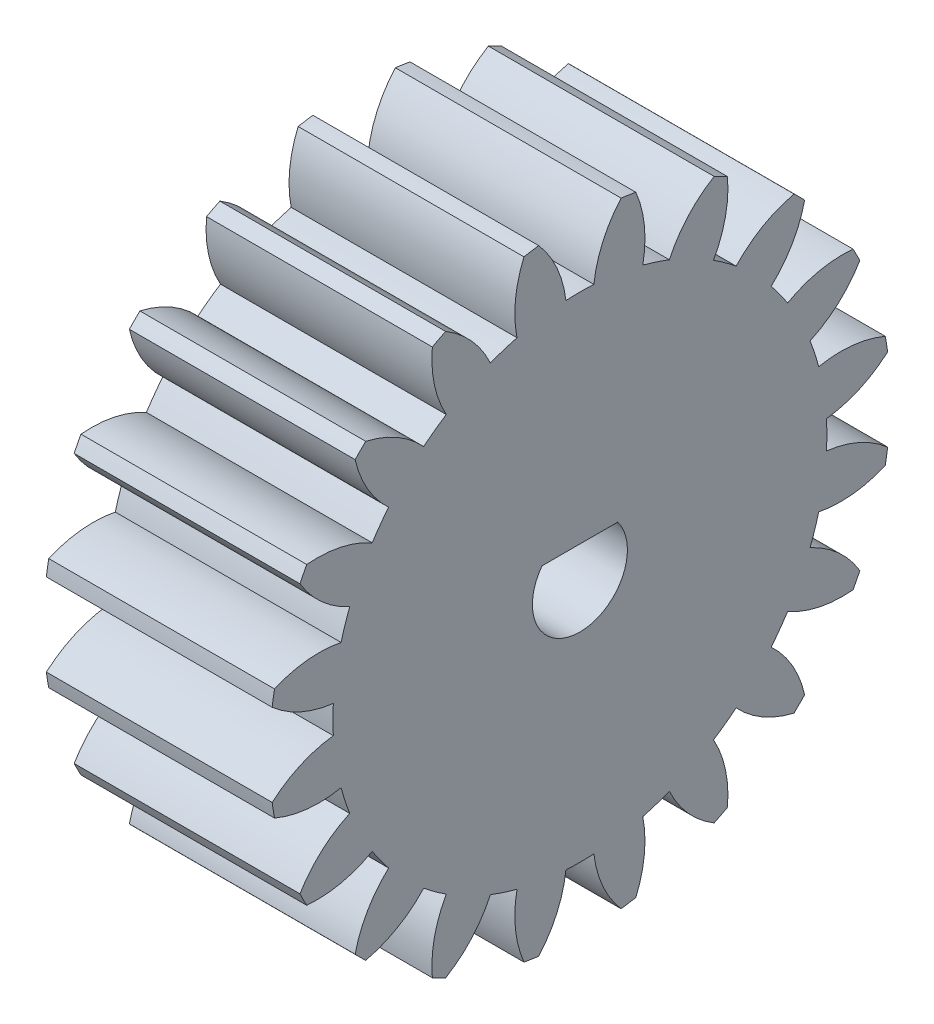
ISO-10303-21;
HEADER;
FILE_DESCRIPTION(('STEP AP214'),'2;1');
FILE_NAME('part.step','',(''),(''),'','','');
FILE_SCHEMA(('AUTOMOTIVE_DESIGN { 1 0 10303 214 1 1 1 1 }'));
ENDSEC;
DATA;
#1=APPLICATION_CONTEXT('core data for automotive mechanical design processes');
#2=APPLICATION_PROTOCOL_DEFINITION('international standard','automotive_design',2000,#1);
#3=PRODUCT_CONTEXT('',#1,'mechanical');
#4=PRODUCT('Part','Part','',(#3));
#5=PRODUCT_RELATED_PRODUCT_CATEGORY('part','',(#4));
#6=PRODUCT_DEFINITION_FORMATION('','',#4);
#7=PRODUCT_DEFINITION_CONTEXT('part definition',#1,'design');
#8=PRODUCT_DEFINITION('design','',#6,#7);
#9=PRODUCT_DEFINITION_SHAPE('','',#8);
#10=(LENGTH_UNIT() NAMED_UNIT(*) SI_UNIT(.MILLI.,.METRE.));
#11=(NAMED_UNIT(*) PLANE_ANGLE_UNIT() SI_UNIT($,.RADIAN.));
#12=(NAMED_UNIT(*) SI_UNIT($,.STERADIAN.) SOLID_ANGLE_UNIT());
#13=UNCERTAINTY_MEASURE_WITH_UNIT(LENGTH_MEASURE(1.E-05),#10,'distance_accuracy_value','');
#14=(GEOMETRIC_REPRESENTATION_CONTEXT(3) GLOBAL_UNCERTAINTY_ASSIGNED_CONTEXT((#13)) GLOBAL_UNIT_ASSIGNED_CONTEXT((#10,
#11,#12)) REPRESENTATION_CONTEXT('',''));
#15=CARTESIAN_POINT('',(0.,0.,0.));
#16=DIRECTION('',(0.,0.,1.));
#17=DIRECTION('',(1.,0.,0.));
#18=AXIS2_PLACEMENT_3D('',#15,#16,#17);
#19=CARTESIAN_POINT('',(16.,0.,0.));
#20=DIRECTION('',(-1.,0.,0.));
#21=DIRECTION('',(0.,0.,1.));
#22=AXIS2_PLACEMENT_3D('',#19,#20,#21);
#23=PLANE('',#22);
#24=CARTESIAN_POINT('',(16.,6.70132317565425,12.4004946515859));
#25=DIRECTION('',(-1.,0.,0.));
#26=DIRECTION('',(0.,1.,0.));
#27=AXIS2_PLACEMENT_3D('',#24,#25,#26);
#28=CIRCLE('',#27,6.);
#29=CARTESIAN_POINT('',(16.,0.742635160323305,13.1033724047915));
#30=VERTEX_POINT('',#29);
#31=CARTESIAN_POINT('',(16.,2.18825272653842,16.354251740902));
#32=VERTEX_POINT('',#31);
#33=EDGE_CURVE('E577',#30,#32,#28,.T.);
#34=ORIENTED_EDGE('',*,*,#33,.F.);
#35=CARTESIAN_POINT('',(16.,0.,0.));
#36=DIRECTION('',(-1.,0.,0.));
#37=DIRECTION('',(0.,1.,0.));
#38=AXIS2_PLACEMENT_3D('',#35,#36,#37);
#39=CIRCLE('',#38,13.1244);
#40=CARTESIAN_POINT('',(16.,-0.742635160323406,13.1033724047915));
#41=VERTEX_POINT('',#40);
#42=EDGE_CURVE('E582',#41,#30,#39,.T.);
#43=ORIENTED_EDGE('',*,*,#42,.F.);
#44=CARTESIAN_POINT('',(16.,-6.70132317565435,12.4004946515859));
#45=DIRECTION('',(-1.,0.,0.));
#46=DIRECTION('',(0.,1.,0.));
#47=AXIS2_PLACEMENT_3D('',#44,#45,#46);
#48=CIRCLE('',#47,6.);
#49=CARTESIAN_POINT('',(16.,-2.18825272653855,16.354251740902));
#50=VERTEX_POINT('',#49);
#51=EDGE_CURVE('E579',#50,#41,#48,.T.);
#52=ORIENTED_EDGE('',*,*,#51,.F.);
#53=CARTESIAN_POINT('',(16.,0.,0.));
#54=DIRECTION('',(-1.,0.,0.));
#55=DIRECTION('',(0.,0.,1.));
#56=AXIS2_PLACEMENT_3D('',#53,#54,#55);
#57=CIRCLE('',#56,16.5);
#58=CARTESIAN_POINT('',(16.,-2.97258970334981,16.2300249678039));
#59=VERTEX_POINT('',#58);
#60=EDGE_CURVE('E1143',#59,#50,#57,.T.);
#61=ORIENTED_EDGE('',*,*,#60,.F.);
#62=CARTESIAN_POINT('',(16.,2.54137348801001,13.8643939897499));
#63=DIRECTION('',(-1.,0.,0.));
#64=DIRECTION('',(0.,0.951056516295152,0.309016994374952));
#65=AXIS2_PLACEMENT_3D('',#62,#63,#64);
#66=CIRCLE('',#65,6.);
#67=CARTESIAN_POINT('',(16.,-3.34287674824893,12.6915345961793));
#68=VERTEX_POINT('',#67);
#69=EDGE_CURVE('E698',#68,#59,#66,.T.);
#70=ORIENTED_EDGE('',*,*,#69,.F.);
#71=CARTESIAN_POINT('',(16.,0.,0.));
#72=DIRECTION('',(-1.,0.,0.));
#73=DIRECTION('',(0.,0.951056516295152,0.309016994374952));
#74=AXIS2_PLACEMENT_3D('',#71,#72,#73);
#75=CIRCLE('',#74,13.1244);
#76=CARTESIAN_POINT('',(16.,-4.75545276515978,12.2325608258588));
#77=VERTEX_POINT('',#76);
#78=EDGE_CURVE('E703',#77,#68,#75,.T.);
#79=ORIENTED_EDGE('',*,*,#78,.F.);
#80=CARTESIAN_POINT('',(16.,-10.2053006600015,9.72274849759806));
#81=DIRECTION('',(-1.,0.,0.));
#82=DIRECTION('',(0.,0.951056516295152,0.309016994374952));
#83=AXIS2_PLACEMENT_3D('',#80,#81,#82);
#84=CIRCLE('',#83,6.);
#85=CARTESIAN_POINT('',(16.,-7.13489373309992,14.8776104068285));
#86=VERTEX_POINT('',#85);
#87=EDGE_CURVE('E700',#86,#77,#84,.T.);
#88=ORIENTED_EDGE('',*,*,#87,.F.);
#89=CARTESIAN_POINT('',(16.,-7.84245434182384,14.5170902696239));
#90=VERTEX_POINT('',#89);
#91=EDGE_CURVE('E1137',#90,#86,#57,.T.);
#92=ORIENTED_EDGE('',*,*,#91,.F.);
#93=CARTESIAN_POINT('',(16.,-1.86734354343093,13.971149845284));
#94=DIRECTION('',(-1.,0.,0.));
#95=DIRECTION('',(0.,0.809016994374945,0.587785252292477));
#96=AXIS2_PLACEMENT_3D('',#93,#94,#95);
#97=CIRCLE('',#96,6.);
#98=CARTESIAN_POINT('',(16.,-7.1011645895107,11.0373609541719));
#99=VERTEX_POINT('',#98);
#100=EDGE_CURVE('E681',#99,#90,#97,.T.);
#101=ORIENTED_EDGE('',*,*,#100,.F.);
#102=CARTESIAN_POINT('',(16.,0.,0.));
#103=DIRECTION('',(-1.,0.,0.));
#104=DIRECTION('',(0.,0.809016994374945,0.587785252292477));
#105=AXIS2_PLACEMENT_3D('',#102,#103,#104);
#106=CIRCLE('',#105,13.1244);
#107=CARTESIAN_POINT('',(16.,-8.30277352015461,10.1643409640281));
#108=VERTEX_POINT('',#107);
#109=EDGE_CURVE('E686',#108,#99,#106,.T.);
#110=ORIENTED_EDGE('',*,*,#109,.F.);
#111=CARTESIAN_POINT('',(16.,-12.7103122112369,6.09327197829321));
#112=DIRECTION('',(-1.,0.,0.));
#113=DIRECTION('',(0.,0.809016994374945,0.587785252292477));
#114=AXIS2_PLACEMENT_3D('',#111,#112,#113);
#115=CIRCLE('',#114,6.);
#116=CARTESIAN_POINT('',(16.,-11.3831216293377,11.9446449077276));
#117=VERTEX_POINT('',#116);
#118=EDGE_CURVE('E683',#117,#108,#115,.T.);
#119=ORIENTED_EDGE('',*,*,#118,.F.);
#120=CARTESIAN_POINT('',(16.,-11.9446449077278,11.3831216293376));
#121=VERTEX_POINT('',#120);
#122=EDGE_CURVE('E1131',#121,#117,#57,.T.);
#123=ORIENTED_EDGE('',*,*,#122,.F.);
#124=CARTESIAN_POINT('',(16.,-6.09327197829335,12.7103122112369));
#125=DIRECTION('',(-1.,0.,0.));
#126=DIRECTION('',(0.,0.587785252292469,0.809016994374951));
#127=AXIS2_PLACEMENT_3D('',#124,#125,#126);
#128=CIRCLE('',#127,6.);
#129=CARTESIAN_POINT('',(16.,-10.1643409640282,8.30277352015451));
#130=VERTEX_POINT('',#129);
#131=EDGE_CURVE('E664',#130,#121,#128,.T.);
#132=ORIENTED_EDGE('',*,*,#131,.F.);
#133=CARTESIAN_POINT('',(16.,0.,0.));
#134=DIRECTION('',(-1.,0.,0.));
#135=DIRECTION('',(0.,0.587785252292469,0.809016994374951));
#136=AXIS2_PLACEMENT_3D('',#133,#134,#135);
#137=CIRCLE('',#136,13.1244);
#138=CARTESIAN_POINT('',(16.,-11.037360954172,7.10116458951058));
#139=VERTEX_POINT('',#138);
#140=EDGE_CURVE('E669',#139,#130,#137,.T.);
#141=ORIENTED_EDGE('',*,*,#140,.F.);
#142=CARTESIAN_POINT('',(16.,-13.971149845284,1.86734354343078));
#143=DIRECTION('',(-1.,0.,0.));
#144=DIRECTION('',(0.,0.587785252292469,0.809016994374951));
#145=AXIS2_PLACEMENT_3D('',#142,#143,#144);
#146=CIRCLE('',#145,6.);
#147=CARTESIAN_POINT('',(16.,-14.517090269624,7.84245434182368));
#148=VERTEX_POINT('',#147);
#149=EDGE_CURVE('E666',#148,#139,#146,.T.);
#150=ORIENTED_EDGE('',*,*,#149,.F.);
#151=CARTESIAN_POINT('',(16.,-14.8776104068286,7.13489373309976));
#152=VERTEX_POINT('',#151);
#153=EDGE_CURVE('E1125',#152,#148,#57,.T.);
#154=ORIENTED_EDGE('',*,*,#153,.F.);
#155=CARTESIAN_POINT('',(16.,-9.72274849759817,10.2053006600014));
#156=DIRECTION('',(-1.,0.,0.));
#157=DIRECTION('',(0.,0.309016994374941,0.951056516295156));
#158=AXIS2_PLACEMENT_3D('',#155,#156,#157);
#159=CIRCLE('',#158,6.);
#160=CARTESIAN_POINT('',(16.,-12.2325608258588,4.75545276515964));
#161=VERTEX_POINT('',#160);
#162=EDGE_CURVE('E628',#161,#152,#159,.T.);
#163=ORIENTED_EDGE('',*,*,#162,.F.);
#164=CARTESIAN_POINT('',(16.,0.,0.));
#165=DIRECTION('',(-1.,0.,0.));
#166=DIRECTION('',(0.,0.309016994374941,0.951056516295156));
#167=AXIS2_PLACEMENT_3D('',#164,#165,#166);
#168=CIRCLE('',#167,13.1244);
#169=CARTESIAN_POINT('',(16.,-12.6915345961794,3.34287674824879));
#170=VERTEX_POINT('',#169);
#171=EDGE_CURVE('E633',#170,#161,#168,.T.);
#172=ORIENTED_EDGE('',*,*,#171,.F.);
#173=CARTESIAN_POINT('',(16.,-13.8643939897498,-2.54137348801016));
#174=DIRECTION('',(-1.,0.,0.));
#175=DIRECTION('',(0.,0.309016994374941,0.951056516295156));
#176=AXIS2_PLACEMENT_3D('',#173,#174,#175);
#177=CIRCLE('',#176,6.);
#178=CARTESIAN_POINT('',(16.,-16.230024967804,2.97258970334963));
#179=VERTEX_POINT('',#178);
#180=EDGE_CURVE('E630',#179,#170,#177,.T.);
#181=ORIENTED_EDGE('',*,*,#180,.F.);
#182=CARTESIAN_POINT('',(16.,-16.354251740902,2.18825272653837));
#183=VERTEX_POINT('',#182);
#184=EDGE_CURVE('E1119',#183,#179,#57,.T.);
#185=ORIENTED_EDGE('',*,*,#184,.F.);
#186=CARTESIAN_POINT('',(16.,-12.4004946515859,6.70132317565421));
#187=DIRECTION('',(-1.,0.,0.));
#188=DIRECTION('',(0.,0.,1.));
#189=AXIS2_PLACEMENT_3D('',#186,#187,#188);
#190=CIRCLE('',#189,6.);
#191=CARTESIAN_POINT('',(16.,-13.1033724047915,0.742635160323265));
#192=VERTEX_POINT('',#191);
#193=EDGE_CURVE('E647',#192,#183,#190,.T.);
#194=ORIENTED_EDGE('',*,*,#193,.F.);
#195=CARTESIAN_POINT('',(16.,0.,0.));
#196=DIRECTION('',(-1.,0.,0.));
#197=DIRECTION('',(0.,0.,1.));
#198=AXIS2_PLACEMENT_3D('',#195,#196,#197);
#199=CIRCLE('',#198,13.1244);
#200=CARTESIAN_POINT('',(16.,-13.1033724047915,-0.742635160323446));
#201=VERTEX_POINT('',#200);
#202=EDGE_CURVE('E652',#201,#192,#199,.T.);
#203=ORIENTED_EDGE('',*,*,#202,.F.);
#204=CARTESIAN_POINT('',(16.,-12.4004946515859,-6.70132317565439));
#205=DIRECTION('',(-1.,0.,0.));
#206=DIRECTION('',(0.,0.,1.));
#207=AXIS2_PLACEMENT_3D('',#204,#205,#206);
#208=CIRCLE('',#207,6.);
#209=CARTESIAN_POINT('',(16.,-16.354251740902,-2.1882527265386));
#210=VERTEX_POINT('',#209);
#211=EDGE_CURVE('E649',#210,#201,#208,.T.);
#212=ORIENTED_EDGE('',*,*,#211,.F.);
#213=CARTESIAN_POINT('',(16.,-16.2300249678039,-2.97258970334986));
#214=VERTEX_POINT('',#213);
#215=EDGE_CURVE('E1113',#214,#210,#57,.T.);
#216=ORIENTED_EDGE('',*,*,#215,.F.);
#217=CARTESIAN_POINT('',(16.,-13.8643939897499,2.54137348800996));
#218=DIRECTION('',(-1.,0.,0.));
#219=DIRECTION('',(0.,-0.309016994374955,0.951056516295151));
#220=AXIS2_PLACEMENT_3D('',#217,#218,#219);
#221=CIRCLE('',#220,6.);
#222=CARTESIAN_POINT('',(16.,-12.6915345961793,-3.34287674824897));
#223=VERTEX_POINT('',#222);
#224=EDGE_CURVE('E766',#223,#214,#221,.T.);
#225=ORIENTED_EDGE('',*,*,#224,.F.);
#226=CARTESIAN_POINT('',(16.,0.,0.));
#227=DIRECTION('',(-1.,0.,0.));
#228=DIRECTION('',(0.,-0.309016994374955,0.951056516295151));
#229=AXIS2_PLACEMENT_3D('',#226,#227,#228);
#230=CIRCLE('',#229,13.1244);
#231=CARTESIAN_POINT('',(16.,-12.2325608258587,-4.75545276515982));
#232=VERTEX_POINT('',#231);
#233=EDGE_CURVE('E771',#232,#223,#230,.T.);
#234=ORIENTED_EDGE('',*,*,#233,.F.);
#235=CARTESIAN_POINT('',(16.,-9.72274849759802,-10.2053006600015));
#236=DIRECTION('',(-1.,0.,0.));
#237=DIRECTION('',(0.,-0.309016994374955,0.951056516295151));
#238=AXIS2_PLACEMENT_3D('',#235,#236,#237);
#239=CIRCLE('',#238,6.);
#240=CARTESIAN_POINT('',(16.,-14.8776104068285,-7.13489373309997));
#241=VERTEX_POINT('',#240);
#242=EDGE_CURVE('E768',#241,#232,#239,.T.);
#243=ORIENTED_EDGE('',*,*,#242,.F.);
#244=CARTESIAN_POINT('',(16.,-14.5170902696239,-7.84245434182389));
#245=VERTEX_POINT('',#244);
#246=EDGE_CURVE('E1107',#245,#241,#57,.T.);
#247=ORIENTED_EDGE('',*,*,#246,.F.);
#248=CARTESIAN_POINT('',(16.,-13.971149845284,-1.86734354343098));
#249=DIRECTION('',(-1.,0.,0.));
#250=DIRECTION('',(0.,-0.58778525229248,0.809016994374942));
#251=AXIS2_PLACEMENT_3D('',#248,#249,#250);
#252=CIRCLE('',#251,6.);
#253=CARTESIAN_POINT('',(16.,-11.0373609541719,-7.10116458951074));
#254=VERTEX_POINT('',#253);
#255=EDGE_CURVE('E749',#254,#245,#252,.T.);
#256=ORIENTED_EDGE('',*,*,#255,.F.);
#257=CARTESIAN_POINT('',(16.,0.,0.));
#258=DIRECTION('',(-1.,0.,0.));
#259=DIRECTION('',(0.,-0.58778525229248,0.809016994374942));
#260=AXIS2_PLACEMENT_3D('',#257,#258,#259);
#261=CIRCLE('',#260,13.1244);
#262=CARTESIAN_POINT('',(16.,-10.1643409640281,-8.30277352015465));
#263=VERTEX_POINT('',#262);
#264=EDGE_CURVE('E754',#263,#254,#261,.T.);
#265=ORIENTED_EDGE('',*,*,#264,.F.);
#266=CARTESIAN_POINT('',(16.,-6.09327197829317,-12.710312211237));
#267=DIRECTION('',(-1.,0.,0.));
#268=DIRECTION('',(0.,-0.58778525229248,0.809016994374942));
#269=AXIS2_PLACEMENT_3D('',#266,#267,#268);
#270=CIRCLE('',#269,6.);
#271=CARTESIAN_POINT('',(16.,-11.9446449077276,-11.3831216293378));
#272=VERTEX_POINT('',#271);
#273=EDGE_CURVE('E751',#272,#263,#270,.T.);
#274=ORIENTED_EDGE('',*,*,#273,.F.);
#275=CARTESIAN_POINT('',(16.,-11.3831216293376,-11.9446449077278));
#276=VERTEX_POINT('',#275);
#277=EDGE_CURVE('E1101',#276,#272,#57,.T.);
#278=ORIENTED_EDGE('',*,*,#277,.F.);
#279=CARTESIAN_POINT('',(16.,-12.7103122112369,-6.0932719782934));
#280=DIRECTION('',(-1.,0.,0.));
#281=DIRECTION('',(0.,-0.809016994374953,0.587785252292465));
#282=AXIS2_PLACEMENT_3D('',#279,#280,#281);
#283=CIRCLE('',#282,6.);
#284=CARTESIAN_POINT('',(16.,-8.30277352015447,-10.1643409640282));
#285=VERTEX_POINT('',#284);
#286=EDGE_CURVE('E732',#285,#276,#283,.T.);
#287=ORIENTED_EDGE('',*,*,#286,.F.);
#288=CARTESIAN_POINT('',(16.,0.,0.));
#289=DIRECTION('',(-1.,0.,0.));
#290=DIRECTION('',(0.,-0.809016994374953,0.587785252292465));
#291=AXIS2_PLACEMENT_3D('',#288,#289,#290);
#292=CIRCLE('',#291,13.1244);
#293=CARTESIAN_POINT('',(16.,-7.10116458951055,-11.037360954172));
#294=VERTEX_POINT('',#293);
#295=EDGE_CURVE('E737',#294,#285,#292,.T.);
#296=ORIENTED_EDGE('',*,*,#295,.F.);
#297=CARTESIAN_POINT('',(16.,-1.86734354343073,-13.971149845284));
#298=DIRECTION('',(-1.,0.,0.));
#299=DIRECTION('',(0.,-0.809016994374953,0.587785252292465));
#300=AXIS2_PLACEMENT_3D('',#297,#298,#299);
#301=CIRCLE('',#300,6.);
#302=CARTESIAN_POINT('',(16.,-7.84245434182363,-14.517090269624));
#303=VERTEX_POINT('',#302);
#304=EDGE_CURVE('E734',#303,#294,#301,.T.);
#305=ORIENTED_EDGE('',*,*,#304,.F.);
#306=CARTESIAN_POINT('',(16.,-7.13489373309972,-14.8776104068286));
#307=VERTEX_POINT('',#306);
#308=EDGE_CURVE('E1095',#307,#303,#57,.T.);
#309=ORIENTED_EDGE('',*,*,#308,.F.);
#310=CARTESIAN_POINT('',(16.,-10.2053006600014,-9.72274849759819));
#311=DIRECTION('',(-1.,0.,0.));
#312=DIRECTION('',(0.,-0.951056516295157,0.309016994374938));
#313=AXIS2_PLACEMENT_3D('',#310,#311,#312);
#314=CIRCLE('',#313,6.);
#315=CARTESIAN_POINT('',(16.,-4.75545276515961,-12.2325608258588));
#316=VERTEX_POINT('',#315);
#317=EDGE_CURVE('E713',#316,#307,#314,.T.);
#318=ORIENTED_EDGE('',*,*,#317,.F.);
#319=CARTESIAN_POINT('',(16.,0.,0.));
#320=DIRECTION('',(-1.,0.,0.));
#321=DIRECTION('',(0.,-0.951056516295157,0.309016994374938));
#322=AXIS2_PLACEMENT_3D('',#319,#320,#321);
#323=CIRCLE('',#322,13.1244);
#324=CARTESIAN_POINT('',(16.,-3.34287674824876,-12.6915345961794));
#325=VERTEX_POINT('',#324);
#326=EDGE_CURVE('E718',#325,#316,#323,.T.);
#327=ORIENTED_EDGE('',*,*,#326,.F.);
#328=CARTESIAN_POINT('',(16.,2.5413734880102,-13.8643939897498));
#329=DIRECTION('',(-1.,0.,0.));
#330=DIRECTION('',(0.,-0.951056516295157,0.309016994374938));
#331=AXIS2_PLACEMENT_3D('',#328,#329,#330);
#332=CIRCLE('',#331,6.);
#333=CARTESIAN_POINT('',(16.,-2.97258970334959,-16.230024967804));
#334=VERTEX_POINT('',#333);
#335=EDGE_CURVE('E715',#334,#325,#332,.T.);
#336=ORIENTED_EDGE('',*,*,#335,.F.);
#337=CARTESIAN_POINT('',(16.,-2.18825272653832,-16.354251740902));
#338=VERTEX_POINT('',#337);
#339=EDGE_CURVE('E1090',#338,#334,#57,.T.);
#340=ORIENTED_EDGE('',*,*,#339,.F.);
#341=CARTESIAN_POINT('',(16.,-6.70132317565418,-12.400494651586));
#342=DIRECTION('',(-1.,0.,0.));
#343=DIRECTION('',(0.,-1.,0.));
#344=AXIS2_PLACEMENT_3D('',#341,#342,#343);
#345=CIRCLE('',#344,6.);
#346=CARTESIAN_POINT('',(16.,-0.742635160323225,-13.1033724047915));
#347=VERTEX_POINT('',#346);
#348=EDGE_CURVE('E832',#347,#338,#345,.T.);
#349=ORIENTED_EDGE('',*,*,#348,.F.);
#350=CARTESIAN_POINT('',(16.,0.,0.));
#351=DIRECTION('',(-1.,0.,0.));
#352=DIRECTION('',(0.,-1.,0.));
#353=AXIS2_PLACEMENT_3D('',#350,#351,#352);
#354=CIRCLE('',#353,13.1244);
#355=CARTESIAN_POINT('',(16.,0.742635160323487,-13.1033724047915));
#356=VERTEX_POINT('',#355);
#357=EDGE_CURVE('E837',#356,#347,#354,.T.);
#358=ORIENTED_EDGE('',*,*,#357,.F.);
#359=CARTESIAN_POINT('',(16.,6.70132317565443,-12.4004946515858));
#360=DIRECTION('',(-1.,0.,0.));
#361=DIRECTION('',(0.,-1.,0.));
#362=AXIS2_PLACEMENT_3D('',#359,#360,#361);
#363=CIRCLE('',#362,6.);
#364=CARTESIAN_POINT('',(16.,2.18825272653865,-16.354251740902));
#365=VERTEX_POINT('',#364);
#366=EDGE_CURVE('E834',#365,#356,#363,.T.);
#367=ORIENTED_EDGE('',*,*,#366,.F.);
#368=CARTESIAN_POINT('',(16.,2.97258970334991,-16.2300249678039));
#369=VERTEX_POINT('',#368);
#370=EDGE_CURVE('E1084',#369,#365,#57,.T.);
#371=ORIENTED_EDGE('',*,*,#370,.F.);
#372=CARTESIAN_POINT('',(16.,-2.54137348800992,-13.8643939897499));
#373=DIRECTION('',(-1.,0.,0.));
#374=DIRECTION('',(0.,-0.95105651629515,-0.309016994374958));
#375=AXIS2_PLACEMENT_3D('',#372,#373,#374);
#376=CIRCLE('',#375,6.);
#377=CARTESIAN_POINT('',(16.,3.34287674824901,-12.6915345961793));
#378=VERTEX_POINT('',#377);
#379=EDGE_CURVE('E849',#378,#369,#376,.T.);
#380=ORIENTED_EDGE('',*,*,#379,.F.);
#381=CARTESIAN_POINT('',(16.,0.,0.));
#382=DIRECTION('',(-1.,0.,0.));
#383=DIRECTION('',(0.,-0.95105651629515,-0.309016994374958));
#384=AXIS2_PLACEMENT_3D('',#381,#382,#383);
#385=CIRCLE('',#384,13.1244);
#386=CARTESIAN_POINT('',(16.,4.75545276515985,-12.2325608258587));
#387=VERTEX_POINT('',#386);
#388=EDGE_CURVE('E854',#387,#378,#385,.T.);
#389=ORIENTED_EDGE('',*,*,#388,.F.);
#390=CARTESIAN_POINT('',(16.,10.2053006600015,-9.72274849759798));
#391=DIRECTION('',(-1.,0.,0.));
#392=DIRECTION('',(0.,-0.95105651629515,-0.309016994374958));
#393=AXIS2_PLACEMENT_3D('',#390,#391,#392);
#394=CIRCLE('',#393,6.);
#395=CARTESIAN_POINT('',(16.,7.13489373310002,-14.8776104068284));
#396=VERTEX_POINT('',#395);
#397=EDGE_CURVE('E851',#396,#387,#394,.T.);
#398=ORIENTED_EDGE('',*,*,#397,.F.);
#399=CARTESIAN_POINT('',(16.,7.84245434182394,-14.5170902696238));
#400=VERTEX_POINT('',#399);
#401=EDGE_CURVE('E1078',#400,#396,#57,.T.);
#402=ORIENTED_EDGE('',*,*,#401,.F.);
#403=CARTESIAN_POINT('',(16.,1.86734354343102,-13.971149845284));
#404=DIRECTION('',(-1.,0.,0.));
#405=DIRECTION('',(0.,-0.80901699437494,-0.587785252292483));
#406=AXIS2_PLACEMENT_3D('',#403,#404,#405);
#407=CIRCLE('',#406,6.);
#408=CARTESIAN_POINT('',(16.,7.10116458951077,-11.0373609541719));
#409=VERTEX_POINT('',#408);
#410=EDGE_CURVE('E815',#409,#400,#407,.T.);
#411=ORIENTED_EDGE('',*,*,#410,.F.);
#412=CARTESIAN_POINT('',(16.,0.,0.));
#413=DIRECTION('',(-1.,0.,0.));
#414=DIRECTION('',(0.,-0.80901699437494,-0.587785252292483));
#415=AXIS2_PLACEMENT_3D('',#412,#413,#414);
#416=CIRCLE('',#415,13.1244);
#417=CARTESIAN_POINT('',(16.,8.30277352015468,-10.164340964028));
#418=VERTEX_POINT('',#417);
#419=EDGE_CURVE('E820',#418,#409,#416,.T.);
#420=ORIENTED_EDGE('',*,*,#419,.F.);
#421=CARTESIAN_POINT('',(16.,12.710312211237,-6.09327197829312));
#422=DIRECTION('',(-1.,0.,0.));
#423=DIRECTION('',(0.,-0.80901699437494,-0.587785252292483));
#424=AXIS2_PLACEMENT_3D('',#421,#422,#423);
#425=CIRCLE('',#424,6.);
#426=CARTESIAN_POINT('',(16.,11.3831216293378,-11.9446449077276));
#427=VERTEX_POINT('',#426);
#428=EDGE_CURVE('E817',#427,#418,#425,.T.);
#429=ORIENTED_EDGE('',*,*,#428,.F.);
#430=CARTESIAN_POINT('',(16.,11.9446449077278,-11.3831216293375));
#431=VERTEX_POINT('',#430);
#432=EDGE_CURVE('E1072',#431,#427,#57,.T.);
#433=ORIENTED_EDGE('',*,*,#432,.F.);
#434=CARTESIAN_POINT('',(16.,6.09327197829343,-12.7103122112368));
#435=DIRECTION('',(-1.,0.,0.));
#436=DIRECTION('',(0.,-0.587785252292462,-0.809016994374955));
#437=AXIS2_PLACEMENT_3D('',#434,#435,#436);
#438=CIRCLE('',#437,6.);
#439=CARTESIAN_POINT('',(16.,10.1643409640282,-8.30277352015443));
#440=VERTEX_POINT('',#439);
#441=EDGE_CURVE('E798',#440,#431,#438,.T.);
#442=ORIENTED_EDGE('',*,*,#441,.F.);
#443=CARTESIAN_POINT('',(16.,0.,0.));
#444=DIRECTION('',(-1.,0.,0.));
#445=DIRECTION('',(0.,-0.587785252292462,-0.809016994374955));
#446=AXIS2_PLACEMENT_3D('',#443,#444,#445);
#447=CIRCLE('',#446,13.1244);
#448=CARTESIAN_POINT('',(16.,11.0373609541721,-7.1011645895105));
#449=VERTEX_POINT('',#448);
#450=EDGE_CURVE('E803',#449,#440,#447,.T.);
#451=ORIENTED_EDGE('',*,*,#450,.F.);
#452=CARTESIAN_POINT('',(16.,13.971149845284,-1.86734354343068));
#453=DIRECTION('',(-1.,0.,0.));
#454=DIRECTION('',(0.,-0.587785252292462,-0.809016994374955));
#455=AXIS2_PLACEMENT_3D('',#452,#453,#454);
#456=CIRCLE('',#455,6.);
#457=CARTESIAN_POINT('',(16.,14.517090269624,-7.84245434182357));
#458=VERTEX_POINT('',#457);
#459=EDGE_CURVE('E800',#458,#449,#456,.T.);
#460=ORIENTED_EDGE('',*,*,#459,.F.);
#461=CARTESIAN_POINT('',(16.,14.8776104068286,-7.13489373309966));
#462=VERTEX_POINT('',#461);
#463=EDGE_CURVE('E990',#462,#458,#57,.T.);
#464=ORIENTED_EDGE('',*,*,#463,.F.);
#465=CARTESIAN_POINT('',(16.,9.72274849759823,-10.2053006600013));
#466=DIRECTION('',(-1.,0.,0.));
#467=DIRECTION('',(0.,-0.309016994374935,-0.951056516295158));
#468=AXIS2_PLACEMENT_3D('',#465,#466,#467);
#469=CIRCLE('',#468,6.);
#470=CARTESIAN_POINT('',(16.,12.2325608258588,-4.75545276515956));
#471=VERTEX_POINT('',#470);
#472=EDGE_CURVE('E781',#471,#462,#469,.T.);
#473=ORIENTED_EDGE('',*,*,#472,.F.);
#474=CARTESIAN_POINT('',(16.,0.,0.));
#475=DIRECTION('',(-1.,0.,0.));
#476=DIRECTION('',(0.,-0.309016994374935,-0.951056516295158));
#477=AXIS2_PLACEMENT_3D('',#474,#475,#476);
#478=CIRCLE('',#477,13.1244);
#479=CARTESIAN_POINT('',(16.,12.6915345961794,-3.34287674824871));
#480=VERTEX_POINT('',#479);
#481=EDGE_CURVE('E786',#480,#471,#478,.T.);
#482=ORIENTED_EDGE('',*,*,#481,.F.);
#483=CARTESIAN_POINT('',(16.,13.8643939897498,2.54137348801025));
#484=DIRECTION('',(-1.,0.,0.));
#485=DIRECTION('',(0.,-0.309016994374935,-0.951056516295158));
#486=AXIS2_PLACEMENT_3D('',#483,#484,#485);
#487=CIRCLE('',#486,6.);
#488=CARTESIAN_POINT('',(16.,16.230024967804,-2.97258970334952));
#489=VERTEX_POINT('',#488);
#490=EDGE_CURVE('E783',#489,#480,#487,.T.);
#491=ORIENTED_EDGE('',*,*,#490,.F.);
#492=CARTESIAN_POINT('',(16.,16.354251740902,-2.18825272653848));
#493=VERTEX_POINT('',#492);
#494=EDGE_CURVE('E986',#493,#489,#57,.T.);
#495=ORIENTED_EDGE('',*,*,#494,.F.);
#496=CARTESIAN_POINT('',(16.,12.4004946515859,-6.7013231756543));
#497=DIRECTION('',(-1.,0.,0.));
#498=DIRECTION('',(0.,0.,-1.));
#499=AXIS2_PLACEMENT_3D('',#496,#497,#498);
#500=CIRCLE('',#499,6.);
#501=CARTESIAN_POINT('',(16.,13.1033724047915,-0.742635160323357));
#502=VERTEX_POINT('',#501);
#503=EDGE_CURVE('E958',#502,#493,#500,.T.);
#504=ORIENTED_EDGE('',*,*,#503,.F.);
#505=CARTESIAN_POINT('',(16.,0.,0.));
#506=DIRECTION('',(-1.,0.,0.));
#507=DIRECTION('',(0.,0.,-1.));
#508=AXIS2_PLACEMENT_3D('',#505,#506,#507);
#509=CIRCLE('',#508,13.1244);
#510=CARTESIAN_POINT('',(16.,13.1033724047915,0.742635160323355));
#511=VERTEX_POINT('',#510);
#512=EDGE_CURVE('E963',#511,#502,#509,.T.);
#513=ORIENTED_EDGE('',*,*,#512,.F.);
#514=CARTESIAN_POINT('',(16.,12.4004946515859,6.7013231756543));
#515=DIRECTION('',(-1.,0.,0.));
#516=DIRECTION('',(0.,0.,-1.));
#517=AXIS2_PLACEMENT_3D('',#514,#515,#516);
#518=CIRCLE('',#517,6.);
#519=CARTESIAN_POINT('',(16.,16.354251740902,2.18825272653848));
#520=VERTEX_POINT('',#519);
#521=EDGE_CURVE('E960',#520,#511,#518,.T.);
#522=ORIENTED_EDGE('',*,*,#521,.F.);
#523=CARTESIAN_POINT('',(16.,16.2300249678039,2.97258970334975));
#524=VERTEX_POINT('',#523);
#525=EDGE_CURVE('E983',#524,#520,#57,.T.);
#526=ORIENTED_EDGE('',*,*,#525,.F.);
#527=CARTESIAN_POINT('',(16.,13.8643939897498,-2.54137348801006));
#528=DIRECTION('',(-1.,0.,0.));
#529=DIRECTION('',(0.,0.309016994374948,-0.951056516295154));
#530=AXIS2_PLACEMENT_3D('',#527,#528,#529);
#531=CIRCLE('',#530,6.);
#532=CARTESIAN_POINT('',(16.,12.6915345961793,3.34287674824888));
#533=VERTEX_POINT('',#532);
#534=EDGE_CURVE('E936',#533,#524,#531,.T.);
#535=ORIENTED_EDGE('',*,*,#534,.F.);
#536=CARTESIAN_POINT('',(16.,0.,0.));
#537=DIRECTION('',(-1.,0.,0.));
#538=DIRECTION('',(0.,0.309016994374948,-0.951056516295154));
#539=AXIS2_PLACEMENT_3D('',#536,#537,#538);
#540=CIRCLE('',#539,13.1244);
#541=CARTESIAN_POINT('',(16.,12.2325608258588,4.75545276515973));
#542=VERTEX_POINT('',#541);
#543=EDGE_CURVE('E941',#542,#533,#540,.T.);
#544=ORIENTED_EDGE('',*,*,#543,.F.);
#545=CARTESIAN_POINT('',(16.,9.72274849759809,10.2053006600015));
#546=DIRECTION('',(-1.,0.,0.));
#547=DIRECTION('',(0.,0.309016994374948,-0.951056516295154));
#548=AXIS2_PLACEMENT_3D('',#545,#546,#547);
#549=CIRCLE('',#548,6.);
#550=CARTESIAN_POINT('',(16.,14.8776104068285,7.13489373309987));
#551=VERTEX_POINT('',#550);
#552=EDGE_CURVE('E938',#551,#542,#549,.T.);
#553=ORIENTED_EDGE('',*,*,#552,.F.);
#554=CARTESIAN_POINT('',(16.,14.5170902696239,7.84245434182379));
#555=VERTEX_POINT('',#554);
#556=EDGE_CURVE('E991',#555,#551,#57,.T.);
#557=ORIENTED_EDGE('',*,*,#556,.F.);
#558=CARTESIAN_POINT('',(16.,13.971149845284,1.86734354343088));
#559=DIRECTION('',(-1.,0.,0.));
#560=DIRECTION('',(0.,0.587785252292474,-0.809016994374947));
#561=AXIS2_PLACEMENT_3D('',#558,#559,#560);
#562=CIRCLE('',#561,6.);
#563=CARTESIAN_POINT('',(16.,11.037360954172,7.10116458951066));
#564=VERTEX_POINT('',#563);
#565=EDGE_CURVE('E611',#564,#555,#562,.T.);
#566=ORIENTED_EDGE('',*,*,#565,.F.);
#567=CARTESIAN_POINT('',(16.,0.,0.));
#568=DIRECTION('',(-1.,0.,0.));
#569=DIRECTION('',(0.,0.587785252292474,-0.809016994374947));
#570=AXIS2_PLACEMENT_3D('',#567,#568,#569);
#571=CIRCLE('',#570,13.1244);
#572=CARTESIAN_POINT('',(16.,10.1643409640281,8.30277352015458));
#573=VERTEX_POINT('',#572);
#574=EDGE_CURVE('E616',#573,#564,#571,.T.);
#575=ORIENTED_EDGE('',*,*,#574,.F.);
#576=CARTESIAN_POINT('',(16.,6.09327197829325,12.7103122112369));
#577=DIRECTION('',(-1.,0.,0.));
#578=DIRECTION('',(0.,0.587785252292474,-0.809016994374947));
#579=AXIS2_PLACEMENT_3D('',#576,#577,#578);
#580=CIRCLE('',#579,6.);
#581=CARTESIAN_POINT('',(16.,11.9446449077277,11.3831216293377));
#582=VERTEX_POINT('',#581);
#583=EDGE_CURVE('E613',#582,#573,#580,.T.);
#584=ORIENTED_EDGE('',*,*,#583,.F.);
#585=CARTESIAN_POINT('',(16.,11.3831216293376,11.9446449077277));
#586=VERTEX_POINT('',#585);
#587=EDGE_CURVE('E1070',#586,#582,#57,.T.);
#588=ORIENTED_EDGE('',*,*,#587,.F.);
#589=CARTESIAN_POINT('',(16.,12.7103122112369,6.0932719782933));
#590=DIRECTION('',(-1.,0.,0.));
#591=DIRECTION('',(0.,0.809016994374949,-0.587785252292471));
#592=AXIS2_PLACEMENT_3D('',#589,#590,#591);
#593=CIRCLE('',#592,6.);
#594=CARTESIAN_POINT('',(16.,8.30277352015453,10.1643409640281));
#595=VERTEX_POINT('',#594);
#596=EDGE_CURVE('E594',#595,#586,#593,.T.);
#597=ORIENTED_EDGE('',*,*,#596,.F.);
#598=CARTESIAN_POINT('',(16.,0.,0.));
#599=DIRECTION('',(-1.,0.,0.));
#600=DIRECTION('',(0.,0.809016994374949,-0.587785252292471));
#601=AXIS2_PLACEMENT_3D('',#598,#599,#600);
#602=CIRCLE('',#601,13.1244);
#603=CARTESIAN_POINT('',(16.,7.10116458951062,11.037360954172));
#604=VERTEX_POINT('',#603);
#605=EDGE_CURVE('E599',#604,#595,#602,.T.);
#606=ORIENTED_EDGE('',*,*,#605,.F.);
#607=CARTESIAN_POINT('',(16.,1.86734354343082,13.971149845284));
#608=DIRECTION('',(-1.,0.,0.));
#609=DIRECTION('',(0.,0.809016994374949,-0.587785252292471));
#610=AXIS2_PLACEMENT_3D('',#607,#608,#609);
#611=CIRCLE('',#610,6.);
#612=CARTESIAN_POINT('',(16.,7.84245434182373,14.5170902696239));
#613=VERTEX_POINT('',#612);
#614=EDGE_CURVE('E596',#613,#604,#611,.T.);
#615=ORIENTED_EDGE('',*,*,#614,.F.);
#616=CARTESIAN_POINT('',(16.,7.13489373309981,14.8776104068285));
#617=VERTEX_POINT('',#616);
#618=EDGE_CURVE('E1155',#617,#613,#57,.T.);
#619=ORIENTED_EDGE('',*,*,#618,.F.);
#620=CARTESIAN_POINT('',(16.,10.2053006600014,9.72274849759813));
#621=DIRECTION('',(-1.,0.,0.));
#622=DIRECTION('',(0.,0.951056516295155,-0.309016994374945));
#623=AXIS2_PLACEMENT_3D('',#620,#621,#622);
#624=CIRCLE('',#623,6.);
#625=CARTESIAN_POINT('',(16.,4.75545276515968,12.2325608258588));
#626=VERTEX_POINT('',#625);
#627=EDGE_CURVE('E558',#626,#617,#624,.T.);
#628=ORIENTED_EDGE('',*,*,#627,.F.);
#629=CARTESIAN_POINT('',(16.,0.,0.));
#630=DIRECTION('',(-1.,0.,0.));
#631=DIRECTION('',(0.,0.951056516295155,-0.309016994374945));
#632=AXIS2_PLACEMENT_3D('',#629,#630,#631);
#633=CIRCLE('',#632,13.1244);
#634=CARTESIAN_POINT('',(16.,3.34287674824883,12.6915345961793));
#635=VERTEX_POINT('',#634);
#636=EDGE_CURVE('E563',#635,#626,#633,.T.);
#637=ORIENTED_EDGE('',*,*,#636,.F.);
#638=CARTESIAN_POINT('',(16.,-2.54137348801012,13.8643939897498));
#639=DIRECTION('',(-1.,0.,0.));
#640=DIRECTION('',(0.,0.951056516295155,-0.309016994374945));
#641=AXIS2_PLACEMENT_3D('',#638,#639,#640);
#642=CIRCLE('',#641,6.);
#643=CARTESIAN_POINT('',(16.,2.97258970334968,16.2300249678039));
#644=VERTEX_POINT('',#643);
#645=EDGE_CURVE('E560',#644,#635,#642,.T.);
#646=ORIENTED_EDGE('',*,*,#645,.F.);
#647=EDGE_CURVE('E1149',#32,#644,#57,.T.);
#648=ORIENTED_EDGE('',*,*,#647,.F.);
#649=EDGE_LOOP('',(#34,#43,#52,#61,#70,#79,#88,#92,#101,#110,#119,#123,#132,#141,#150,#154,#163,
#172,#181,#185,#194,#203,#212,#216,#225,#234,#243,#247,#256,#265,#274,#278,#287,#296,#305,#309,
#318,#327,#336,#340,#349,#358,#367,#371,#380,#389,#398,#402,#411,#420,#429,#433,#442,#451,#460,
#464,#473,#482,#491,#495,#504,#513,#522,#526,#535,#544,#553,#557,#566,#575,#584,#588,#597,#606,
#615,#619,#628,#637,#646,#648));
#650=FACE_BOUND('',#649,.T.);
#651=CARTESIAN_POINT('',(16.,0.,0.));
#652=DIRECTION('',(1.,0.,0.));
#653=DIRECTION('',(0.,0.,-1.));
#654=AXIS2_PLACEMENT_3D('',#651,#652,#653);
#655=CIRCLE('',#654,2.525);
#656=CARTESIAN_POINT('',(16.,1.52824245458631,2.01));
#657=VERTEX_POINT('',#656);
#658=CARTESIAN_POINT('',(16.,1.52824245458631,-2.01));
#659=VERTEX_POINT('',#658);
#660=EDGE_CURVE('E547',#657,#659,#655,.T.);
#661=ORIENTED_EDGE('',*,*,#660,.F.);
#662=DIRECTION('',(0.,0.,1.));
#663=VECTOR('',#662,1.);
#664=CARTESIAN_POINT('',(16.,1.52824245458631,2.01));
#665=LINE('',#664,#663);
#666=EDGE_CURVE('E543',#659,#657,#665,.T.);
#667=ORIENTED_EDGE('',*,*,#666,.F.);
#668=EDGE_LOOP('',(#661,#667));
#669=FACE_BOUND('',#668,.T.);
#670=ADVANCED_FACE('F39',(#650,#669),#23,.F.);
#671=CARTESIAN_POINT('',(4.,0.,0.));
#672=DIRECTION('',(1.,0.,0.));
#673=DIRECTION('',(0.,0.,-1.));
#674=AXIS2_PLACEMENT_3D('',#671,#672,#673);
#675=PLANE('',#674);
#676=CARTESIAN_POINT('',(4.,6.70132317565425,12.4004946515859));
#677=DIRECTION('',(-1.,0.,0.));
#678=DIRECTION('',(0.,1.,0.));
#679=AXIS2_PLACEMENT_3D('',#676,#677,#678);
#680=CIRCLE('',#679,6.);
#681=CARTESIAN_POINT('',(4.,0.742635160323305,13.1033724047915));
#682=VERTEX_POINT('',#681);
#683=CARTESIAN_POINT('',(4.,2.18825272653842,16.354251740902));
#684=VERTEX_POINT('',#683);
#685=EDGE_CURVE('E585',#682,#684,#680,.T.);
#686=ORIENTED_EDGE('',*,*,#685,.T.);
#687=CARTESIAN_POINT('',(4.,0.,0.));
#688=DIRECTION('',(-1.,0.,0.));
#689=DIRECTION('',(0.,0.,1.));
#690=AXIS2_PLACEMENT_3D('',#687,#688,#689);
#691=CIRCLE('',#690,16.5);
#692=CARTESIAN_POINT('',(4.,2.97258970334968,16.2300249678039));
#693=VERTEX_POINT('',#692);
#694=EDGE_CURVE('E1188',#684,#693,#691,.T.);
#695=ORIENTED_EDGE('',*,*,#694,.T.);
#696=CARTESIAN_POINT('',(4.,-2.54137348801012,13.8643939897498));
#697=DIRECTION('',(1.,0.,0.));
#698=DIRECTION('',(0.,0.,-1.));
#699=AXIS2_PLACEMENT_3D('',#696,#697,#698);
#700=CIRCLE('',#699,6.);
#701=CARTESIAN_POINT('',(4.,3.34287674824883,12.6915345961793));
#702=VERTEX_POINT('',#701);
#703=EDGE_CURVE('E1029',#702,#693,#700,.T.);
#704=ORIENTED_EDGE('',*,*,#703,.F.);
#705=CARTESIAN_POINT('',(4.,0.,0.));
#706=DIRECTION('',(-1.,0.,0.));
#707=DIRECTION('',(0.,0.951056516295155,-0.309016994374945));
#708=AXIS2_PLACEMENT_3D('',#705,#706,#707);
#709=CIRCLE('',#708,13.1244);
#710=CARTESIAN_POINT('',(4.,4.75545276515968,12.2325608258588));
#711=VERTEX_POINT('',#710);
#712=EDGE_CURVE('E561',#702,#711,#709,.T.);
#713=ORIENTED_EDGE('',*,*,#712,.T.);
#714=CARTESIAN_POINT('',(4.,10.2053006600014,9.72274849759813));
#715=DIRECTION('',(-1.,0.,0.));
#716=DIRECTION('',(0.,0.951056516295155,-0.309016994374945));
#717=AXIS2_PLACEMENT_3D('',#714,#715,#716);
#718=CIRCLE('',#717,6.);
#719=CARTESIAN_POINT('',(4.,7.13489373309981,14.8776104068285));
#720=VERTEX_POINT('',#719);
#721=EDGE_CURVE('E566',#711,#720,#718,.T.);
#722=ORIENTED_EDGE('',*,*,#721,.T.);
#723=CARTESIAN_POINT('',(4.,7.84245434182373,14.5170902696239));
#724=VERTEX_POINT('',#723);
#725=EDGE_CURVE('E1186',#720,#724,#691,.T.);
#726=ORIENTED_EDGE('',*,*,#725,.T.);
#727=CARTESIAN_POINT('',(4.,1.86734354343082,13.971149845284));
#728=DIRECTION('',(1.,0.,0.));
#729=DIRECTION('',(0.,0.,-1.));
#730=AXIS2_PLACEMENT_3D('',#727,#728,#729);
#731=CIRCLE('',#730,6.);
#732=CARTESIAN_POINT('',(4.,7.10116458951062,11.037360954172));
#733=VERTEX_POINT('',#732);
#734=EDGE_CURVE('E1025',#733,#724,#731,.T.);
#735=ORIENTED_EDGE('',*,*,#734,.F.);
#736=CARTESIAN_POINT('',(4.,0.,0.));
#737=DIRECTION('',(-1.,0.,0.));
#738=DIRECTION('',(0.,0.809016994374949,-0.587785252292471));
#739=AXIS2_PLACEMENT_3D('',#736,#737,#738);
#740=CIRCLE('',#739,13.1244);
#741=CARTESIAN_POINT('',(4.,8.30277352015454,10.1643409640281));
#742=VERTEX_POINT('',#741);
#743=EDGE_CURVE('E597',#733,#742,#740,.T.);
#744=ORIENTED_EDGE('',*,*,#743,.T.);
#745=CARTESIAN_POINT('',(4.,12.7103122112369,6.0932719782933));
#746=DIRECTION('',(-1.,0.,0.));
#747=DIRECTION('',(0.,0.809016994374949,-0.587785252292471));
#748=AXIS2_PLACEMENT_3D('',#745,#746,#747);
#749=CIRCLE('',#748,6.);
#750=CARTESIAN_POINT('',(4.,11.3831216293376,11.9446449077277));
#751=VERTEX_POINT('',#750);
#752=EDGE_CURVE('E576',#742,#751,#749,.T.);
#753=ORIENTED_EDGE('',*,*,#752,.T.);
#754=CARTESIAN_POINT('',(4.,11.9446449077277,11.3831216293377));
#755=VERTEX_POINT('',#754);
#756=EDGE_CURVE('E1185',#751,#755,#691,.T.);
#757=ORIENTED_EDGE('',*,*,#756,.T.);
#758=CARTESIAN_POINT('',(4.,6.09327197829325,12.7103122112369));
#759=DIRECTION('',(1.,0.,0.));
#760=DIRECTION('',(0.,0.,-1.));
#761=AXIS2_PLACEMENT_3D('',#758,#759,#760);
#762=CIRCLE('',#761,6.);
#763=CARTESIAN_POINT('',(4.,10.1643409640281,8.30277352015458));
#764=VERTEX_POINT('',#763);
#765=EDGE_CURVE('E1027',#764,#755,#762,.T.);
#766=ORIENTED_EDGE('',*,*,#765,.F.);
#767=CARTESIAN_POINT('',(4.,0.,0.));
#768=DIRECTION('',(-1.,0.,0.));
#769=DIRECTION('',(0.,0.587785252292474,-0.809016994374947));
#770=AXIS2_PLACEMENT_3D('',#767,#768,#769);
#771=CIRCLE('',#770,13.1244);
#772=CARTESIAN_POINT('',(4.,11.037360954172,7.10116458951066));
#773=VERTEX_POINT('',#772);
#774=EDGE_CURVE('E614',#764,#773,#771,.T.);
#775=ORIENTED_EDGE('',*,*,#774,.T.);
#776=CARTESIAN_POINT('',(4.,13.971149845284,1.86734354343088));
#777=DIRECTION('',(-1.,0.,0.));
#778=DIRECTION('',(0.,0.587785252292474,-0.809016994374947));
#779=AXIS2_PLACEMENT_3D('',#776,#777,#778);
#780=CIRCLE('',#779,6.);
#781=CARTESIAN_POINT('',(4.,14.5170902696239,7.84245434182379));
#782=VERTEX_POINT('',#781);
#783=EDGE_CURVE('E610',#773,#782,#780,.T.);
#784=ORIENTED_EDGE('',*,*,#783,.T.);
#785=CARTESIAN_POINT('',(4.,14.8776104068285,7.13489373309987));
#786=VERTEX_POINT('',#785);
#787=EDGE_CURVE('E985',#782,#786,#691,.T.);
#788=ORIENTED_EDGE('',*,*,#787,.T.);
#789=CARTESIAN_POINT('',(4.,9.72274849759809,10.2053006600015));
#790=DIRECTION('',(1.,0.,0.));
#791=DIRECTION('',(0.,0.,-1.));
#792=AXIS2_PLACEMENT_3D('',#789,#790,#791);
#793=CIRCLE('',#792,6.);
#794=CARTESIAN_POINT('',(4.,12.2325608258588,4.75545276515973));
#795=VERTEX_POINT('',#794);
#796=EDGE_CURVE('E994',#795,#786,#793,.T.);
#797=ORIENTED_EDGE('',*,*,#796,.F.);
#798=CARTESIAN_POINT('',(4.,0.,0.));
#799=DIRECTION('',(-1.,0.,0.));
#800=DIRECTION('',(0.,0.309016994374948,-0.951056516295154));
#801=AXIS2_PLACEMENT_3D('',#798,#799,#800);
#802=CIRCLE('',#801,13.1244);
#803=CARTESIAN_POINT('',(4.,12.6915345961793,3.34287674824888));
#804=VERTEX_POINT('',#803);
#805=EDGE_CURVE('E939',#795,#804,#802,.T.);
#806=ORIENTED_EDGE('',*,*,#805,.T.);
#807=CARTESIAN_POINT('',(4.,13.8643939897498,-2.54137348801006));
#808=DIRECTION('',(-1.,0.,0.));
#809=DIRECTION('',(0.,0.309016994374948,-0.951056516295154));
#810=AXIS2_PLACEMENT_3D('',#807,#808,#809);
#811=CIRCLE('',#810,6.);
#812=CARTESIAN_POINT('',(4.,16.2300249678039,2.97258970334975));
#813=VERTEX_POINT('',#812);
#814=EDGE_CURVE('E935',#804,#813,#811,.T.);
#815=ORIENTED_EDGE('',*,*,#814,.T.);
#816=CARTESIAN_POINT('',(4.,16.354251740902,2.18825272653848));
#817=VERTEX_POINT('',#816);
#818=EDGE_CURVE('E979',#813,#817,#691,.T.);
#819=ORIENTED_EDGE('',*,*,#818,.T.);
#820=CARTESIAN_POINT('',(4.,12.4004946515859,6.7013231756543));
#821=DIRECTION('',(1.,0.,0.));
#822=DIRECTION('',(0.,0.,-1.));
#823=AXIS2_PLACEMENT_3D('',#820,#821,#822);
#824=CIRCLE('',#823,6.);
#825=CARTESIAN_POINT('',(4.,13.1033724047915,0.742635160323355));
#826=VERTEX_POINT('',#825);
#827=EDGE_CURVE('E989',#826,#817,#824,.T.);
#828=ORIENTED_EDGE('',*,*,#827,.F.);
#829=CARTESIAN_POINT('',(4.,0.,0.));
#830=DIRECTION('',(-1.,0.,0.));
#831=DIRECTION('',(0.,0.,-1.));
#832=AXIS2_PLACEMENT_3D('',#829,#830,#831);
#833=CIRCLE('',#832,13.1244);
#834=CARTESIAN_POINT('',(4.,13.1033724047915,-0.742635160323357));
#835=VERTEX_POINT('',#834);
#836=EDGE_CURVE('E961',#826,#835,#833,.T.);
#837=ORIENTED_EDGE('',*,*,#836,.T.);
#838=CARTESIAN_POINT('',(4.,12.4004946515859,-6.7013231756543));
#839=DIRECTION('',(-1.,0.,0.));
#840=DIRECTION('',(0.,0.,-1.));
#841=AXIS2_PLACEMENT_3D('',#838,#839,#840);
#842=CIRCLE('',#841,6.);
#843=CARTESIAN_POINT('',(4.,16.354251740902,-2.18825272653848));
#844=VERTEX_POINT('',#843);
#845=EDGE_CURVE('E957',#835,#844,#842,.T.);
#846=ORIENTED_EDGE('',*,*,#845,.T.);
#847=CARTESIAN_POINT('',(4.,16.230024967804,-2.97258970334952));
#848=VERTEX_POINT('',#847);
#849=EDGE_CURVE('E980',#844,#848,#691,.T.);
#850=ORIENTED_EDGE('',*,*,#849,.T.);
#851=CARTESIAN_POINT('',(4.,13.8643939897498,2.54137348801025));
#852=DIRECTION('',(1.,0.,0.));
#853=DIRECTION('',(0.,0.,-1.));
#854=AXIS2_PLACEMENT_3D('',#851,#852,#853);
#855=CIRCLE('',#854,6.);
#856=CARTESIAN_POINT('',(4.,12.6915345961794,-3.34287674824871));
#857=VERTEX_POINT('',#856);
#858=EDGE_CURVE('E1003',#857,#848,#855,.T.);
#859=ORIENTED_EDGE('',*,*,#858,.F.);
#860=CARTESIAN_POINT('',(4.,0.,0.));
#861=DIRECTION('',(-1.,0.,0.));
#862=DIRECTION('',(0.,-0.309016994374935,-0.951056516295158));
#863=AXIS2_PLACEMENT_3D('',#860,#861,#862);
#864=CIRCLE('',#863,13.1244);
#865=CARTESIAN_POINT('',(4.,12.2325608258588,-4.75545276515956));
#866=VERTEX_POINT('',#865);
#867=EDGE_CURVE('E784',#857,#866,#864,.T.);
#868=ORIENTED_EDGE('',*,*,#867,.T.);
#869=CARTESIAN_POINT('',(4.,9.72274849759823,-10.2053006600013));
#870=DIRECTION('',(-1.,0.,0.));
#871=DIRECTION('',(0.,-0.309016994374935,-0.951056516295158));
#872=AXIS2_PLACEMENT_3D('',#869,#870,#871);
#873=CIRCLE('',#872,6.);
#874=CARTESIAN_POINT('',(4.,14.8776104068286,-7.13489373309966));
#875=VERTEX_POINT('',#874);
#876=EDGE_CURVE('E557',#866,#875,#873,.T.);
#877=ORIENTED_EDGE('',*,*,#876,.T.);
#878=CARTESIAN_POINT('',(4.,14.517090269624,-7.84245434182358));
#879=VERTEX_POINT('',#878);
#880=EDGE_CURVE('E984',#875,#879,#691,.T.);
#881=ORIENTED_EDGE('',*,*,#880,.T.);
#882=CARTESIAN_POINT('',(4.,13.971149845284,-1.86734354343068));
#883=DIRECTION('',(1.,0.,0.));
#884=DIRECTION('',(0.,0.,-1.));
#885=AXIS2_PLACEMENT_3D('',#882,#883,#884);
#886=CIRCLE('',#885,6.);
#887=CARTESIAN_POINT('',(4.,11.0373609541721,-7.1011645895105));
#888=VERTEX_POINT('',#887);
#889=EDGE_CURVE('E1001',#888,#879,#886,.T.);
#890=ORIENTED_EDGE('',*,*,#889,.F.);
#891=CARTESIAN_POINT('',(4.,0.,0.));
#892=DIRECTION('',(-1.,0.,0.));
#893=DIRECTION('',(0.,-0.587785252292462,-0.809016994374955));
#894=AXIS2_PLACEMENT_3D('',#891,#892,#893);
#895=CIRCLE('',#894,13.1244);
#896=CARTESIAN_POINT('',(4.,10.1643409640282,-8.30277352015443));
#897=VERTEX_POINT('',#896);
#898=EDGE_CURVE('E801',#888,#897,#895,.T.);
#899=ORIENTED_EDGE('',*,*,#898,.T.);
#900=CARTESIAN_POINT('',(4.,6.09327197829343,-12.7103122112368));
#901=DIRECTION('',(-1.,0.,0.));
#902=DIRECTION('',(0.,-0.587785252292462,-0.809016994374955));
#903=AXIS2_PLACEMENT_3D('',#900,#901,#902);
#904=CIRCLE('',#903,6.);
#905=CARTESIAN_POINT('',(4.,11.9446449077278,-11.3831216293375));
#906=VERTEX_POINT('',#905);
#907=EDGE_CURVE('E797',#897,#906,#904,.T.);
#908=ORIENTED_EDGE('',*,*,#907,.T.);
#909=CARTESIAN_POINT('',(4.,11.3831216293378,-11.9446449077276));
#910=VERTEX_POINT('',#909);
#911=EDGE_CURVE('E1193',#906,#910,#691,.T.);
#912=ORIENTED_EDGE('',*,*,#911,.T.);
#913=CARTESIAN_POINT('',(4.,12.710312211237,-6.09327197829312));
#914=DIRECTION('',(1.,0.,0.));
#915=DIRECTION('',(0.,0.,-1.));
#916=AXIS2_PLACEMENT_3D('',#913,#914,#915);
#917=CIRCLE('',#916,6.);
#918=CARTESIAN_POINT('',(4.,8.30277352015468,-10.164340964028));
#919=VERTEX_POINT('',#918);
#920=EDGE_CURVE('E1005',#919,#910,#917,.T.);
#921=ORIENTED_EDGE('',*,*,#920,.F.);
#922=CARTESIAN_POINT('',(4.,0.,0.));
#923=DIRECTION('',(-1.,0.,0.));
#924=DIRECTION('',(0.,-0.80901699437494,-0.587785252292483));
#925=AXIS2_PLACEMENT_3D('',#922,#923,#924);
#926=CIRCLE('',#925,13.1244);
#927=CARTESIAN_POINT('',(4.,7.10116458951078,-11.0373609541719));
#928=VERTEX_POINT('',#927);
#929=EDGE_CURVE('E818',#919,#928,#926,.T.);
#930=ORIENTED_EDGE('',*,*,#929,.T.);
#931=CARTESIAN_POINT('',(4.,1.86734354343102,-13.971149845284));
#932=DIRECTION('',(-1.,0.,0.));
#933=DIRECTION('',(0.,-0.80901699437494,-0.587785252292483));
#934=AXIS2_PLACEMENT_3D('',#931,#932,#933);
#935=CIRCLE('',#934,6.);
#936=CARTESIAN_POINT('',(4.,7.84245434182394,-14.5170902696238));
#937=VERTEX_POINT('',#936);
#938=EDGE_CURVE('E814',#928,#937,#935,.T.);
#939=ORIENTED_EDGE('',*,*,#938,.T.);
#940=CARTESIAN_POINT('',(4.,7.13489373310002,-14.8776104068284));
#941=VERTEX_POINT('',#940);
#942=EDGE_CURVE('E1197',#937,#941,#691,.T.);
#943=ORIENTED_EDGE('',*,*,#942,.T.);
#944=CARTESIAN_POINT('',(4.,10.2053006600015,-9.72274849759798));
#945=DIRECTION('',(1.,0.,0.));
#946=DIRECTION('',(0.,0.,-1.));
#947=AXIS2_PLACEMENT_3D('',#944,#945,#946);
#948=CIRCLE('',#947,6.);
#949=CARTESIAN_POINT('',(4.,4.75545276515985,-12.2325608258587));
#950=VERTEX_POINT('',#949);
#951=EDGE_CURVE('E999',#950,#941,#948,.T.);
#952=ORIENTED_EDGE('',*,*,#951,.F.);
#953=CARTESIAN_POINT('',(4.,0.,0.));
#954=DIRECTION('',(-1.,0.,0.));
#955=DIRECTION('',(0.,-0.95105651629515,-0.309016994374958));
#956=AXIS2_PLACEMENT_3D('',#953,#954,#955);
#957=CIRCLE('',#956,13.1244);
#958=CARTESIAN_POINT('',(4.,3.34287674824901,-12.6915345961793));
#959=VERTEX_POINT('',#958);
#960=EDGE_CURVE('E852',#950,#959,#957,.T.);
#961=ORIENTED_EDGE('',*,*,#960,.T.);
#962=CARTESIAN_POINT('',(4.,-2.54137348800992,-13.8643939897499));
#963=DIRECTION('',(-1.,0.,0.));
#964=DIRECTION('',(0.,-0.95105651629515,-0.309016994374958));
#965=AXIS2_PLACEMENT_3D('',#962,#963,#964);
#966=CIRCLE('',#965,6.);
#967=CARTESIAN_POINT('',(4.,2.97258970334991,-16.2300249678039));
#968=VERTEX_POINT('',#967);
#969=EDGE_CURVE('E831',#959,#968,#966,.T.);
#970=ORIENTED_EDGE('',*,*,#969,.T.);
#971=CARTESIAN_POINT('',(4.,2.18825272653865,-16.354251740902));
#972=VERTEX_POINT('',#971);
#973=EDGE_CURVE('E1201',#968,#972,#691,.T.);
#974=ORIENTED_EDGE('',*,*,#973,.T.);
#975=CARTESIAN_POINT('',(4.,6.70132317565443,-12.4004946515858));
#976=DIRECTION('',(1.,0.,0.));
#977=DIRECTION('',(0.,0.,-1.));
#978=AXIS2_PLACEMENT_3D('',#975,#976,#977);
#979=CIRCLE('',#978,6.);
#980=CARTESIAN_POINT('',(4.,0.742635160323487,-13.1033724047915));
#981=VERTEX_POINT('',#980);
#982=EDGE_CURVE('E997',#981,#972,#979,.T.);
#983=ORIENTED_EDGE('',*,*,#982,.F.);
#984=CARTESIAN_POINT('',(4.,0.,0.));
#985=DIRECTION('',(-1.,0.,0.));
#986=DIRECTION('',(0.,-1.,0.));
#987=AXIS2_PLACEMENT_3D('',#984,#985,#986);
#988=CIRCLE('',#987,13.1244);
#989=CARTESIAN_POINT('',(4.,-0.742635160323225,-13.1033724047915));
#990=VERTEX_POINT('',#989);
#991=EDGE_CURVE('E835',#981,#990,#988,.T.);
#992=ORIENTED_EDGE('',*,*,#991,.T.);
#993=CARTESIAN_POINT('',(4.,-6.70132317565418,-12.400494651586));
#994=DIRECTION('',(-1.,0.,0.));
#995=DIRECTION('',(0.,-1.,0.));
#996=AXIS2_PLACEMENT_3D('',#993,#994,#995);
#997=CIRCLE('',#996,6.);
#998=CARTESIAN_POINT('',(4.,-2.18825272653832,-16.354251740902));
#999=VERTEX_POINT('',#998);
#1000=EDGE_CURVE('E840',#990,#999,#997,.T.);
#1001=ORIENTED_EDGE('',*,*,#1000,.T.);
#1002=CARTESIAN_POINT('',(4.,-2.97258970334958,-16.230024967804));
#1003=VERTEX_POINT('',#1002);
#1004=EDGE_CURVE('E1205',#999,#1003,#691,.T.);
#1005=ORIENTED_EDGE('',*,*,#1004,.T.);
#1006=CARTESIAN_POINT('',(4.,2.5413734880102,-13.8643939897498));
#1007=DIRECTION('',(1.,0.,0.));
#1008=DIRECTION('',(0.,0.,-1.));
#1009=AXIS2_PLACEMENT_3D('',#1006,#1007,#1008);
#1010=CIRCLE('',#1009,6.);
#1011=CARTESIAN_POINT('',(4.,-3.34287674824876,-12.6915345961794));
#1012=VERTEX_POINT('',#1011);
#1013=EDGE_CURVE('E1011',#1012,#1003,#1010,.T.);
#1014=ORIENTED_EDGE('',*,*,#1013,.F.);
#1015=CARTESIAN_POINT('',(4.,0.,0.));
#1016=DIRECTION('',(-1.,0.,0.));
#1017=DIRECTION('',(0.,-0.951056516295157,0.309016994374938));
#1018=AXIS2_PLACEMENT_3D('',#1015,#1016,#1017);
#1019=CIRCLE('',#1018,13.1244);
#1020=CARTESIAN_POINT('',(4.,-4.75545276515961,-12.2325608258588));
#1021=VERTEX_POINT('',#1020);
#1022=EDGE_CURVE('E716',#1012,#1021,#1019,.T.);
#1023=ORIENTED_EDGE('',*,*,#1022,.T.);
#1024=CARTESIAN_POINT('',(4.,-10.2053006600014,-9.72274849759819));
#1025=DIRECTION('',(-1.,0.,0.));
#1026=DIRECTION('',(0.,-0.951056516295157,0.309016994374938));
#1027=AXIS2_PLACEMENT_3D('',#1024,#1025,#1026);
#1028=CIRCLE('',#1027,6.);
#1029=CARTESIAN_POINT('',(4.,-7.13489373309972,-14.8776104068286));
#1030=VERTEX_POINT('',#1029);
#1031=EDGE_CURVE('E721',#1021,#1030,#1028,.T.);
#1032=ORIENTED_EDGE('',*,*,#1031,.T.);
#1033=CARTESIAN_POINT('',(4.,-7.84245434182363,-14.517090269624));
#1034=VERTEX_POINT('',#1033);
#1035=EDGE_CURVE('E1209',#1030,#1034,#691,.T.);
#1036=ORIENTED_EDGE('',*,*,#1035,.T.);
#1037=CARTESIAN_POINT('',(4.,-1.86734354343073,-13.971149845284));
#1038=DIRECTION('',(1.,0.,0.));
#1039=DIRECTION('',(0.,0.,-1.));
#1040=AXIS2_PLACEMENT_3D('',#1037,#1038,#1039);
#1041=CIRCLE('',#1040,6.);
#1042=CARTESIAN_POINT('',(4.,-7.10116458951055,-11.037360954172));
#1043=VERTEX_POINT('',#1042);
#1044=EDGE_CURVE('E1013',#1043,#1034,#1041,.T.);
#1045=ORIENTED_EDGE('',*,*,#1044,.F.);
#1046=CARTESIAN_POINT('',(4.,0.,0.));
#1047=DIRECTION('',(-1.,0.,0.));
#1048=DIRECTION('',(0.,-0.809016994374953,0.587785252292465));
#1049=AXIS2_PLACEMENT_3D('',#1046,#1047,#1048);
#1050=CIRCLE('',#1049,13.1244);
#1051=CARTESIAN_POINT('',(4.,-8.30277352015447,-10.1643409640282));
#1052=VERTEX_POINT('',#1051);
#1053=EDGE_CURVE('E735',#1043,#1052,#1050,.T.);
#1054=ORIENTED_EDGE('',*,*,#1053,.T.);
#1055=CARTESIAN_POINT('',(4.,-12.7103122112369,-6.0932719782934));
#1056=DIRECTION('',(-1.,0.,0.));
#1057=DIRECTION('',(0.,-0.809016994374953,0.587785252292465));
#1058=AXIS2_PLACEMENT_3D('',#1055,#1056,#1057);
#1059=CIRCLE('',#1058,6.);
#1060=CARTESIAN_POINT('',(4.,-11.3831216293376,-11.9446449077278));
#1061=VERTEX_POINT('',#1060);
#1062=EDGE_CURVE('E731',#1052,#1061,#1059,.T.);
#1063=ORIENTED_EDGE('',*,*,#1062,.T.);
#1064=CARTESIAN_POINT('',(4.,-11.9446449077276,-11.3831216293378));
#1065=VERTEX_POINT('',#1064);
#1066=EDGE_CURVE('E1213',#1061,#1065,#691,.T.);
#1067=ORIENTED_EDGE('',*,*,#1066,.T.);
#1068=CARTESIAN_POINT('',(4.,-6.09327197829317,-12.710312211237));
#1069=DIRECTION('',(1.,0.,0.));
#1070=DIRECTION('',(0.,0.,-1.));
#1071=AXIS2_PLACEMENT_3D('',#1068,#1069,#1070);
#1072=CIRCLE('',#1071,6.);
#1073=CARTESIAN_POINT('',(4.,-10.1643409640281,-8.30277352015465));
#1074=VERTEX_POINT('',#1073);
#1075=EDGE_CURVE('E1007',#1074,#1065,#1072,.T.);
#1076=ORIENTED_EDGE('',*,*,#1075,.F.);
#1077=CARTESIAN_POINT('',(4.,0.,0.));
#1078=DIRECTION('',(-1.,0.,0.));
#1079=DIRECTION('',(0.,-0.58778525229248,0.809016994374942));
#1080=AXIS2_PLACEMENT_3D('',#1077,#1078,#1079);
#1081=CIRCLE('',#1080,13.1244);
#1082=CARTESIAN_POINT('',(4.,-11.0373609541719,-7.10116458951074));
#1083=VERTEX_POINT('',#1082);
#1084=EDGE_CURVE('E752',#1074,#1083,#1081,.T.);
#1085=ORIENTED_EDGE('',*,*,#1084,.T.);
#1086=CARTESIAN_POINT('',(4.,-13.971149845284,-1.86734354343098));
#1087=DIRECTION('',(-1.,0.,0.));
#1088=DIRECTION('',(0.,-0.58778525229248,0.809016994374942));
#1089=AXIS2_PLACEMENT_3D('',#1086,#1087,#1088);
#1090=CIRCLE('',#1089,6.);
#1091=CARTESIAN_POINT('',(4.,-14.5170902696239,-7.84245434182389));
#1092=VERTEX_POINT('',#1091);
#1093=EDGE_CURVE('E748',#1083,#1092,#1090,.T.);
#1094=ORIENTED_EDGE('',*,*,#1093,.T.);
#1095=CARTESIAN_POINT('',(4.,-14.8776104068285,-7.13489373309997));
#1096=VERTEX_POINT('',#1095);
#1097=EDGE_CURVE('E1217',#1092,#1096,#691,.T.);
#1098=ORIENTED_EDGE('',*,*,#1097,.T.);
#1099=CARTESIAN_POINT('',(4.,-9.72274849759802,-10.2053006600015));
#1100=DIRECTION('',(1.,0.,0.));
#1101=DIRECTION('',(0.,0.,-1.));
#1102=AXIS2_PLACEMENT_3D('',#1099,#1100,#1101);
#1103=CIRCLE('',#1102,6.);
#1104=CARTESIAN_POINT('',(4.,-12.2325608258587,-4.75545276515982));
#1105=VERTEX_POINT('',#1104);
#1106=EDGE_CURVE('E1009',#1105,#1096,#1103,.T.);
#1107=ORIENTED_EDGE('',*,*,#1106,.F.);
#1108=CARTESIAN_POINT('',(4.,0.,0.));
#1109=DIRECTION('',(-1.,0.,0.));
#1110=DIRECTION('',(0.,-0.309016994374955,0.951056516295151));
#1111=AXIS2_PLACEMENT_3D('',#1108,#1109,#1110);
#1112=CIRCLE('',#1111,13.1244);
#1113=CARTESIAN_POINT('',(4.,-12.6915345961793,-3.34287674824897));
#1114=VERTEX_POINT('',#1113);
#1115=EDGE_CURVE('E769',#1105,#1114,#1112,.T.);
#1116=ORIENTED_EDGE('',*,*,#1115,.T.);
#1117=CARTESIAN_POINT('',(4.,-13.8643939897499,2.54137348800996));
#1118=DIRECTION('',(-1.,0.,0.));
#1119=DIRECTION('',(0.,-0.309016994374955,0.951056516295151));
#1120=AXIS2_PLACEMENT_3D('',#1117,#1118,#1119);
#1121=CIRCLE('',#1120,6.);
#1122=CARTESIAN_POINT('',(4.,-16.2300249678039,-2.97258970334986));
#1123=VERTEX_POINT('',#1122);
#1124=EDGE_CURVE('E765',#1114,#1123,#1121,.T.);
#1125=ORIENTED_EDGE('',*,*,#1124,.T.);
#1126=CARTESIAN_POINT('',(4.,-16.354251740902,-2.1882527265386));
#1127=VERTEX_POINT('',#1126);
#1128=EDGE_CURVE('E1221',#1123,#1127,#691,.T.);
#1129=ORIENTED_EDGE('',*,*,#1128,.T.);
#1130=CARTESIAN_POINT('',(4.,-12.4004946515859,-6.70132317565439));
#1131=DIRECTION('',(1.,0.,0.));
#1132=DIRECTION('',(0.,0.,-1.));
#1133=AXIS2_PLACEMENT_3D('',#1130,#1131,#1132);
#1134=CIRCLE('',#1133,6.);
#1135=CARTESIAN_POINT('',(4.,-13.1033724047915,-0.742635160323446));
#1136=VERTEX_POINT('',#1135);
#1137=EDGE_CURVE('E1019',#1136,#1127,#1134,.T.);
#1138=ORIENTED_EDGE('',*,*,#1137,.F.);
#1139=CARTESIAN_POINT('',(4.,0.,0.));
#1140=DIRECTION('',(-1.,0.,0.));
#1141=DIRECTION('',(0.,0.,1.));
#1142=AXIS2_PLACEMENT_3D('',#1139,#1140,#1141);
#1143=CIRCLE('',#1142,13.1244);
#1144=CARTESIAN_POINT('',(4.,-13.1033724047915,0.742635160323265));
#1145=VERTEX_POINT('',#1144);
#1146=EDGE_CURVE('E650',#1136,#1145,#1143,.T.);
#1147=ORIENTED_EDGE('',*,*,#1146,.T.);
#1148=CARTESIAN_POINT('',(4.,-12.4004946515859,6.70132317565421));
#1149=DIRECTION('',(-1.,0.,0.));
#1150=DIRECTION('',(0.,0.,1.));
#1151=AXIS2_PLACEMENT_3D('',#1148,#1149,#1150);
#1152=CIRCLE('',#1151,6.);
#1153=CARTESIAN_POINT('',(4.,-16.354251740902,2.18825272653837));
#1154=VERTEX_POINT('',#1153);
#1155=EDGE_CURVE('E655',#1145,#1154,#1152,.T.);
#1156=ORIENTED_EDGE('',*,*,#1155,.T.);
#1157=CARTESIAN_POINT('',(4.,-16.230024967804,2.97258970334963));
#1158=VERTEX_POINT('',#1157);
#1159=EDGE_CURVE('E1225',#1154,#1158,#691,.T.);
#1160=ORIENTED_EDGE('',*,*,#1159,.T.);
#1161=CARTESIAN_POINT('',(4.,-13.8643939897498,-2.54137348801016));
#1162=DIRECTION('',(1.,0.,0.));
#1163=DIRECTION('',(0.,0.,-1.));
#1164=AXIS2_PLACEMENT_3D('',#1161,#1162,#1163);
#1165=CIRCLE('',#1164,6.);
#1166=CARTESIAN_POINT('',(4.,-12.6915345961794,3.34287674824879));
#1167=VERTEX_POINT('',#1166);
#1168=EDGE_CURVE('E1021',#1167,#1158,#1165,.T.);
#1169=ORIENTED_EDGE('',*,*,#1168,.F.);
#1170=CARTESIAN_POINT('',(4.,0.,0.));
#1171=DIRECTION('',(-1.,0.,0.));
#1172=DIRECTION('',(0.,0.309016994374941,0.951056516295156));
#1173=AXIS2_PLACEMENT_3D('',#1170,#1171,#1172);
#1174=CIRCLE('',#1173,13.1244);
#1175=CARTESIAN_POINT('',(4.,-12.2325608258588,4.75545276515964));
#1176=VERTEX_POINT('',#1175);
#1177=EDGE_CURVE('E631',#1167,#1176,#1174,.T.);
#1178=ORIENTED_EDGE('',*,*,#1177,.T.);
#1179=CARTESIAN_POINT('',(4.,-9.72274849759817,10.2053006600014));
#1180=DIRECTION('',(-1.,0.,0.));
#1181=DIRECTION('',(0.,0.309016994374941,0.951056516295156));
#1182=AXIS2_PLACEMENT_3D('',#1179,#1180,#1181);
#1183=CIRCLE('',#1182,6.);
#1184=CARTESIAN_POINT('',(4.,-14.8776104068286,7.13489373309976));
#1185=VERTEX_POINT('',#1184);
#1186=EDGE_CURVE('E636',#1176,#1185,#1183,.T.);
#1187=ORIENTED_EDGE('',*,*,#1186,.T.);
#1188=CARTESIAN_POINT('',(4.,-14.517090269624,7.84245434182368));
#1189=VERTEX_POINT('',#1188);
#1190=EDGE_CURVE('E1229',#1185,#1189,#691,.T.);
#1191=ORIENTED_EDGE('',*,*,#1190,.T.);
#1192=CARTESIAN_POINT('',(4.,-13.971149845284,1.86734354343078));
#1193=DIRECTION('',(1.,0.,0.));
#1194=DIRECTION('',(0.,0.,-1.));
#1195=AXIS2_PLACEMENT_3D('',#1192,#1193,#1194);
#1196=CIRCLE('',#1195,6.);
#1197=CARTESIAN_POINT('',(4.,-11.037360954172,7.10116458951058));
#1198=VERTEX_POINT('',#1197);
#1199=EDGE_CURVE('E1023',#1198,#1189,#1196,.T.);
#1200=ORIENTED_EDGE('',*,*,#1199,.F.);
#1201=CARTESIAN_POINT('',(4.,0.,0.));
#1202=DIRECTION('',(-1.,0.,0.));
#1203=DIRECTION('',(0.,0.587785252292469,0.809016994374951));
#1204=AXIS2_PLACEMENT_3D('',#1201,#1202,#1203);
#1205=CIRCLE('',#1204,13.1244);
#1206=CARTESIAN_POINT('',(4.,-10.1643409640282,8.30277352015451));
#1207=VERTEX_POINT('',#1206);
#1208=EDGE_CURVE('E667',#1198,#1207,#1205,.T.);
#1209=ORIENTED_EDGE('',*,*,#1208,.T.);
#1210=CARTESIAN_POINT('',(4.,-6.09327197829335,12.7103122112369));
#1211=DIRECTION('',(-1.,0.,0.));
#1212=DIRECTION('',(0.,0.587785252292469,0.809016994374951));
#1213=AXIS2_PLACEMENT_3D('',#1210,#1211,#1212);
#1214=CIRCLE('',#1213,6.);
#1215=CARTESIAN_POINT('',(4.,-11.9446449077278,11.3831216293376));
#1216=VERTEX_POINT('',#1215);
#1217=EDGE_CURVE('E646',#1207,#1216,#1214,.T.);
#1218=ORIENTED_EDGE('',*,*,#1217,.T.);
#1219=CARTESIAN_POINT('',(4.,-11.3831216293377,11.9446449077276));
#1220=VERTEX_POINT('',#1219);
#1221=EDGE_CURVE('E1233',#1216,#1220,#691,.T.);
#1222=ORIENTED_EDGE('',*,*,#1221,.T.);
#1223=CARTESIAN_POINT('',(4.,-12.7103122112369,6.09327197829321));
#1224=DIRECTION('',(1.,0.,0.));
#1225=DIRECTION('',(0.,0.,-1.));
#1226=AXIS2_PLACEMENT_3D('',#1223,#1224,#1225);
#1227=CIRCLE('',#1226,6.);
#1228=CARTESIAN_POINT('',(4.,-8.30277352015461,10.1643409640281));
#1229=VERTEX_POINT('',#1228);
#1230=EDGE_CURVE('E1015',#1229,#1220,#1227,.T.);
#1231=ORIENTED_EDGE('',*,*,#1230,.F.);
#1232=CARTESIAN_POINT('',(4.,0.,0.));
#1233=DIRECTION('',(-1.,0.,0.));
#1234=DIRECTION('',(0.,0.809016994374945,0.587785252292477));
#1235=AXIS2_PLACEMENT_3D('',#1232,#1233,#1234);
#1236=CIRCLE('',#1235,13.1244);
#1237=CARTESIAN_POINT('',(4.,-7.1011645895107,11.0373609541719));
#1238=VERTEX_POINT('',#1237);
#1239=EDGE_CURVE('E684',#1229,#1238,#1236,.T.);
#1240=ORIENTED_EDGE('',*,*,#1239,.T.);
#1241=CARTESIAN_POINT('',(4.,-1.86734354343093,13.971149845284));
#1242=DIRECTION('',(-1.,0.,0.));
#1243=DIRECTION('',(0.,0.809016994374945,0.587785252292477));
#1244=AXIS2_PLACEMENT_3D('',#1241,#1242,#1243);
#1245=CIRCLE('',#1244,6.);
#1246=CARTESIAN_POINT('',(4.,-7.84245434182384,14.5170902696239));
#1247=VERTEX_POINT('',#1246);
#1248=EDGE_CURVE('E680',#1238,#1247,#1245,.T.);
#1249=ORIENTED_EDGE('',*,*,#1248,.T.);
#1250=CARTESIAN_POINT('',(4.,-7.13489373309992,14.8776104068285));
#1251=VERTEX_POINT('',#1250);
#1252=EDGE_CURVE('E1237',#1247,#1251,#691,.T.);
#1253=ORIENTED_EDGE('',*,*,#1252,.T.);
#1254=CARTESIAN_POINT('',(4.,-10.2053006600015,9.72274849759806));
#1255=DIRECTION('',(1.,0.,0.));
#1256=DIRECTION('',(0.,0.,-1.));
#1257=AXIS2_PLACEMENT_3D('',#1254,#1255,#1256);
#1258=CIRCLE('',#1257,6.);
#1259=CARTESIAN_POINT('',(4.,-4.75545276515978,12.2325608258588));
#1260=VERTEX_POINT('',#1259);
#1261=EDGE_CURVE('E1017',#1260,#1251,#1258,.T.);
#1262=ORIENTED_EDGE('',*,*,#1261,.F.);
#1263=CARTESIAN_POINT('',(4.,0.,0.));
#1264=DIRECTION('',(-1.,0.,0.));
#1265=DIRECTION('',(0.,0.951056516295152,0.309016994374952));
#1266=AXIS2_PLACEMENT_3D('',#1263,#1264,#1265);
#1267=CIRCLE('',#1266,13.1244);
#1268=CARTESIAN_POINT('',(4.,-3.34287674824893,12.6915345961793));
#1269=VERTEX_POINT('',#1268);
#1270=EDGE_CURVE('E701',#1260,#1269,#1267,.T.);
#1271=ORIENTED_EDGE('',*,*,#1270,.T.);
#1272=CARTESIAN_POINT('',(4.,2.54137348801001,13.8643939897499));
#1273=DIRECTION('',(-1.,0.,0.));
#1274=DIRECTION('',(0.,0.951056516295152,0.309016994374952));
#1275=AXIS2_PLACEMENT_3D('',#1272,#1273,#1274);
#1276=CIRCLE('',#1275,6.);
#1277=CARTESIAN_POINT('',(4.,-2.97258970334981,16.2300249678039));
#1278=VERTEX_POINT('',#1277);
#1279=EDGE_CURVE('E697',#1269,#1278,#1276,.T.);
#1280=ORIENTED_EDGE('',*,*,#1279,.T.);
#1281=CARTESIAN_POINT('',(4.,-2.18825272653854,16.354251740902));
#1282=VERTEX_POINT('',#1281);
#1283=EDGE_CURVE('E1241',#1278,#1282,#691,.T.);
#1284=ORIENTED_EDGE('',*,*,#1283,.T.);
#1285=CARTESIAN_POINT('',(4.,-6.70132317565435,12.4004946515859));
#1286=DIRECTION('',(1.,0.,0.));
#1287=DIRECTION('',(0.,0.,-1.));
#1288=AXIS2_PLACEMENT_3D('',#1285,#1286,#1287);
#1289=CIRCLE('',#1288,6.);
#1290=CARTESIAN_POINT('',(4.,-0.742635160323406,13.1033724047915));
#1291=VERTEX_POINT('',#1290);
#1292=EDGE_CURVE('E1031',#1291,#1282,#1289,.T.);
#1293=ORIENTED_EDGE('',*,*,#1292,.F.);
#1294=CARTESIAN_POINT('',(4.,0.,0.));
#1295=DIRECTION('',(-1.,0.,0.));
#1296=DIRECTION('',(0.,1.,0.));
#1297=AXIS2_PLACEMENT_3D('',#1294,#1295,#1296);
#1298=CIRCLE('',#1297,13.1244);
#1299=EDGE_CURVE('E580',#1291,#682,#1298,.T.);
#1300=ORIENTED_EDGE('',*,*,#1299,.T.);
#1301=EDGE_LOOP('',(#686,#695,#704,#713,#722,#726,#735,#744,#753,#757,#766,#775,#784,#788,#797,
#806,#815,#819,#828,#837,#846,#850,#859,#868,#877,#881,#890,#899,#908,#912,#921,#930,#939,#943,
#952,#961,#970,#974,#983,#992,#1001,#1005,#1014,#1023,#1032,#1036,#1045,#1054,#1063,#1067,#1076,
#1085,#1094,#1098,#1107,#1116,#1125,#1129,#1138,#1147,#1156,#1160,#1169,#1178,#1187,#1191,#1200,
#1209,#1218,#1222,#1231,#1240,#1249,#1253,#1262,#1271,#1280,#1284,#1293,#1300));
#1302=FACE_BOUND('',#1301,.T.);
#1303=CARTESIAN_POINT('',(4.,0.,0.));
#1304=DIRECTION('',(1.,0.,0.));
#1305=DIRECTION('',(0.,0.,-1.));
#1306=AXIS2_PLACEMENT_3D('',#1303,#1304,#1305);
#1307=CIRCLE('',#1306,2.525);
#1308=CARTESIAN_POINT('',(4.,1.52824245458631,-2.01));
#1309=VERTEX_POINT('',#1308);
#1310=CARTESIAN_POINT('',(4.,1.52824245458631,2.01));
#1311=VERTEX_POINT('',#1310);
#1312=EDGE_CURVE('E11',#1309,#1311,#1307,.F.);
#1313=ORIENTED_EDGE('',*,*,#1312,.F.);
#1314=DIRECTION('',(0.,0.,-1.));
#1315=VECTOR('',#1314,1.);
#1316=CARTESIAN_POINT('',(4.,1.52824245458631,0.));
#1317=LINE('',#1316,#1315);
#1318=EDGE_CURVE('E46',#1311,#1309,#1317,.T.);
#1319=ORIENTED_EDGE('',*,*,#1318,.F.);
#1320=EDGE_LOOP('',(#1313,#1319));
#1321=FACE_BOUND('',#1320,.T.);
#1322=ADVANCED_FACE('F1033',(#1302,#1321),#675,.F.);
#1323=CARTESIAN_POINT('',(-2.,0.,0.));
#1324=DIRECTION('',(-1.,0.,0.));
#1325=DIRECTION('',(0.,0.,1.));
#1326=AXIS2_PLACEMENT_3D('',#1323,#1324,#1325);
#1327=CYLINDRICAL_SURFACE('',#1326,16.5);
#1328=DIRECTION('',(-1.,0.,0.));
#1329=VECTOR('',#1328,1.);
#1330=CARTESIAN_POINT('',(10.,2.18825272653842,16.354251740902));
#1331=LINE('',#1330,#1329);
#1332=EDGE_CURVE('E933',#32,#684,#1331,.T.);
#1333=ORIENTED_EDGE('',*,*,#1332,.F.);
#1334=ORIENTED_EDGE('',*,*,#647,.T.);
#1335=DIRECTION('',(-1.,0.,0.));
#1336=VECTOR('',#1335,1.);
#1337=CARTESIAN_POINT('',(10.,2.97258970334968,16.2300249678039));
#1338=LINE('',#1337,#1336);
#1339=EDGE_CURVE('E927',#693,#644,#1338,.F.);
#1340=ORIENTED_EDGE('',*,*,#1339,.F.);
#1341=ORIENTED_EDGE('',*,*,#694,.F.);
#1342=EDGE_LOOP('',(#1333,#1334,#1340,#1341));
#1343=FACE_BOUND('',#1342,.T.);
#1344=ADVANCED_FACE('F1035',(#1343),#1327,.T.);
#1345=DIRECTION('',(-1.,0.,0.));
#1346=VECTOR('',#1345,1.);
#1347=CARTESIAN_POINT('',(10.,-2.18825272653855,16.354251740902));
#1348=LINE('',#1347,#1346);
#1349=EDGE_CURVE('E931',#1282,#50,#1348,.F.);
#1350=ORIENTED_EDGE('',*,*,#1349,.F.);
#1351=ORIENTED_EDGE('',*,*,#1283,.F.);
#1352=DIRECTION('',(-1.,0.,0.));
#1353=VECTOR('',#1352,1.);
#1354=CARTESIAN_POINT('',(10.,-2.97258970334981,16.2300249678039));
#1355=LINE('',#1354,#1353);
#1356=EDGE_CURVE('E905',#59,#1278,#1355,.T.);
#1357=ORIENTED_EDGE('',*,*,#1356,.F.);
#1358=ORIENTED_EDGE('',*,*,#60,.T.);
#1359=EDGE_LOOP('',(#1350,#1351,#1357,#1358));
#1360=FACE_BOUND('',#1359,.T.);
#1361=ADVANCED_FACE('F1042',(#1360),#1327,.T.);
#1362=DIRECTION('',(-1.,0.,0.));
#1363=VECTOR('',#1362,1.);
#1364=CARTESIAN_POINT('',(10.,7.13489373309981,14.8776104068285));
#1365=LINE('',#1364,#1363);
#1366=EDGE_CURVE('E929',#617,#720,#1365,.T.);
#1367=ORIENTED_EDGE('',*,*,#1366,.F.);
#1368=ORIENTED_EDGE('',*,*,#618,.T.);
#1369=DIRECTION('',(-1.,0.,0.));
#1370=VECTOR('',#1369,1.);
#1371=CARTESIAN_POINT('',(10.,7.84245434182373,14.5170902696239));
#1372=LINE('',#1371,#1370);
#1373=EDGE_CURVE('E919',#724,#613,#1372,.F.);
#1374=ORIENTED_EDGE('',*,*,#1373,.F.);
#1375=ORIENTED_EDGE('',*,*,#725,.F.);
#1376=EDGE_LOOP('',(#1367,#1368,#1374,#1375));
#1377=FACE_BOUND('',#1376,.T.);
#1378=ADVANCED_FACE('F1264',(#1377),#1327,.T.);
#1379=DIRECTION('',(-1.,0.,0.));
#1380=VECTOR('',#1379,1.);
#1381=CARTESIAN_POINT('',(10.,14.5170902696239,7.84245434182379));
#1382=LINE('',#1381,#1380);
#1383=EDGE_CURVE('E925',#555,#782,#1382,.T.);
#1384=ORIENTED_EDGE('',*,*,#1383,.F.);
#1385=ORIENTED_EDGE('',*,*,#556,.T.);
#1386=DIRECTION('',(-1.,0.,0.));
#1387=VECTOR('',#1386,1.);
#1388=CARTESIAN_POINT('',(10.,14.8776104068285,7.13489373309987));
#1389=LINE('',#1388,#1387);
#1390=EDGE_CURVE('E952',#786,#551,#1389,.F.);
#1391=ORIENTED_EDGE('',*,*,#1390,.F.);
#1392=ORIENTED_EDGE('',*,*,#787,.F.);
#1393=EDGE_LOOP('',(#1384,#1385,#1391,#1392));
#1394=FACE_BOUND('',#1393,.T.);
#1395=ADVANCED_FACE('F2030',(#1394),#1327,.T.);
#1396=DIRECTION('',(-1.,0.,0.));
#1397=VECTOR('',#1396,1.);
#1398=CARTESIAN_POINT('',(10.,11.9446449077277,11.3831216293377));
#1399=LINE('',#1398,#1397);
#1400=EDGE_CURVE('E923',#755,#582,#1399,.F.);
#1401=ORIENTED_EDGE('',*,*,#1400,.F.);
#1402=ORIENTED_EDGE('',*,*,#756,.F.);
#1403=DIRECTION('',(-1.,0.,0.));
#1404=VECTOR('',#1403,1.);
#1405=CARTESIAN_POINT('',(10.,11.3831216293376,11.9446449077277));
#1406=LINE('',#1405,#1404);
#1407=EDGE_CURVE('E921',#586,#751,#1406,.T.);
#1408=ORIENTED_EDGE('',*,*,#1407,.F.);
#1409=ORIENTED_EDGE('',*,*,#587,.T.);
#1410=EDGE_LOOP('',(#1401,#1402,#1408,#1409));
#1411=FACE_BOUND('',#1410,.T.);
#1412=ADVANCED_FACE('F1169',(#1411),#1327,.T.);
#1413=DIRECTION('',(-1.,0.,0.));
#1414=VECTOR('',#1413,1.);
#1415=CARTESIAN_POINT('',(10.,-11.9446449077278,11.3831216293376));
#1416=LINE('',#1415,#1414);
#1417=EDGE_CURVE('E917',#121,#1216,#1416,.T.);
#1418=ORIENTED_EDGE('',*,*,#1417,.F.);
#1419=ORIENTED_EDGE('',*,*,#122,.T.);
#1420=DIRECTION('',(-1.,0.,0.));
#1421=VECTOR('',#1420,1.);
#1422=CARTESIAN_POINT('',(10.,-11.3831216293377,11.9446449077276));
#1423=LINE('',#1422,#1421);
#1424=EDGE_CURVE('E899',#1220,#117,#1423,.F.);
#1425=ORIENTED_EDGE('',*,*,#1424,.F.);
#1426=ORIENTED_EDGE('',*,*,#1221,.F.);
#1427=EDGE_LOOP('',(#1418,#1419,#1425,#1426));
#1428=FACE_BOUND('',#1427,.T.);
#1429=ADVANCED_FACE('F1577',(#1428),#1327,.T.);
#1430=DIRECTION('',(-1.,0.,0.));
#1431=VECTOR('',#1430,1.);
#1432=CARTESIAN_POINT('',(10.,-14.517090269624,7.84245434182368));
#1433=LINE('',#1432,#1431);
#1434=EDGE_CURVE('E915',#1189,#148,#1433,.F.);
#1435=ORIENTED_EDGE('',*,*,#1434,.F.);
#1436=ORIENTED_EDGE('',*,*,#1190,.F.);
#1437=DIRECTION('',(-1.,0.,0.));
#1438=VECTOR('',#1437,1.);
#1439=CARTESIAN_POINT('',(10.,-14.8776104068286,7.13489373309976));
#1440=LINE('',#1439,#1438);
#1441=EDGE_CURVE('E913',#152,#1185,#1440,.T.);
#1442=ORIENTED_EDGE('',*,*,#1441,.F.);
#1443=ORIENTED_EDGE('',*,*,#153,.T.);
#1444=EDGE_LOOP('',(#1435,#1436,#1442,#1443));
#1445=FACE_BOUND('',#1444,.T.);
#1446=ADVANCED_FACE('F1570',(#1445),#1327,.T.);
#1447=DIRECTION('',(-1.,0.,0.));
#1448=VECTOR('',#1447,1.);
#1449=CARTESIAN_POINT('',(10.,-16.230024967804,2.97258970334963));
#1450=LINE('',#1449,#1448);
#1451=EDGE_CURVE('E911',#1158,#179,#1450,.F.);
#1452=ORIENTED_EDGE('',*,*,#1451,.F.);
#1453=ORIENTED_EDGE('',*,*,#1159,.F.);
#1454=DIRECTION('',(-1.,0.,0.));
#1455=VECTOR('',#1454,1.);
#1456=CARTESIAN_POINT('',(10.,-16.354251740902,2.18825272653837));
#1457=LINE('',#1456,#1455);
#1458=EDGE_CURVE('E909',#183,#1154,#1457,.T.);
#1459=ORIENTED_EDGE('',*,*,#1458,.F.);
#1460=ORIENTED_EDGE('',*,*,#184,.T.);
#1461=EDGE_LOOP('',(#1452,#1453,#1459,#1460));
#1462=FACE_BOUND('',#1461,.T.);
#1463=ADVANCED_FACE('F1563',(#1462),#1327,.T.);
#1464=DIRECTION('',(-1.,0.,0.));
#1465=VECTOR('',#1464,1.);
#1466=CARTESIAN_POINT('',(10.,-16.354251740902,-2.1882527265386));
#1467=LINE('',#1466,#1465);
#1468=EDGE_CURVE('E907',#1127,#210,#1467,.F.);
#1469=ORIENTED_EDGE('',*,*,#1468,.F.);
#1470=ORIENTED_EDGE('',*,*,#1128,.F.);
#1471=DIRECTION('',(-1.,0.,0.));
#1472=VECTOR('',#1471,1.);
#1473=CARTESIAN_POINT('',(10.,-16.2300249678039,-2.97258970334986));
#1474=LINE('',#1473,#1472);
#1475=EDGE_CURVE('E889',#214,#1123,#1474,.T.);
#1476=ORIENTED_EDGE('',*,*,#1475,.F.);
#1477=ORIENTED_EDGE('',*,*,#215,.T.);
#1478=EDGE_LOOP('',(#1469,#1470,#1476,#1477));
#1479=FACE_BOUND('',#1478,.T.);
#1480=ADVANCED_FACE('F1556',(#1479),#1327,.T.);
#1481=DIRECTION('',(-1.,0.,0.));
#1482=VECTOR('',#1481,1.);
#1483=CARTESIAN_POINT('',(10.,-7.13489373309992,14.8776104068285));
#1484=LINE('',#1483,#1482);
#1485=EDGE_CURVE('E903',#1251,#86,#1484,.F.);
#1486=ORIENTED_EDGE('',*,*,#1485,.F.);
#1487=ORIENTED_EDGE('',*,*,#1252,.F.);
#1488=DIRECTION('',(-1.,0.,0.));
#1489=VECTOR('',#1488,1.);
#1490=CARTESIAN_POINT('',(10.,-7.84245434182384,14.5170902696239));
#1491=LINE('',#1490,#1489);
#1492=EDGE_CURVE('E901',#90,#1247,#1491,.T.);
#1493=ORIENTED_EDGE('',*,*,#1492,.F.);
#1494=ORIENTED_EDGE('',*,*,#91,.T.);
#1495=EDGE_LOOP('',(#1486,#1487,#1493,#1494));
#1496=FACE_BOUND('',#1495,.T.);
#1497=ADVANCED_FACE('F1584',(#1496),#1327,.T.);
#1498=DIRECTION('',(-1.,0.,0.));
#1499=VECTOR('',#1498,1.);
#1500=CARTESIAN_POINT('',(10.,-11.3831216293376,-11.9446449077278));
#1501=LINE('',#1500,#1499);
#1502=EDGE_CURVE('E897',#276,#1061,#1501,.T.);
#1503=ORIENTED_EDGE('',*,*,#1502,.F.);
#1504=ORIENTED_EDGE('',*,*,#277,.T.);
#1505=DIRECTION('',(-1.,0.,0.));
#1506=VECTOR('',#1505,1.);
#1507=CARTESIAN_POINT('',(10.,-11.9446449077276,-11.3831216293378));
#1508=LINE('',#1507,#1506);
#1509=EDGE_CURVE('E883',#1065,#272,#1508,.F.);
#1510=ORIENTED_EDGE('',*,*,#1509,.F.);
#1511=ORIENTED_EDGE('',*,*,#1066,.F.);
#1512=EDGE_LOOP('',(#1503,#1504,#1510,#1511));
#1513=FACE_BOUND('',#1512,.T.);
#1514=ADVANCED_FACE('F1543',(#1513),#1327,.T.);
#1515=DIRECTION('',(-1.,0.,0.));
#1516=VECTOR('',#1515,1.);
#1517=CARTESIAN_POINT('',(10.,-7.84245434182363,-14.517090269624));
#1518=LINE('',#1517,#1516);
#1519=EDGE_CURVE('E895',#1034,#303,#1518,.F.);
#1520=ORIENTED_EDGE('',*,*,#1519,.F.);
#1521=ORIENTED_EDGE('',*,*,#1035,.F.);
#1522=DIRECTION('',(-1.,0.,0.));
#1523=VECTOR('',#1522,1.);
#1524=CARTESIAN_POINT('',(10.,-7.13489373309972,-14.8776104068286));
#1525=LINE('',#1524,#1523);
#1526=EDGE_CURVE('E893',#307,#1030,#1525,.T.);
#1527=ORIENTED_EDGE('',*,*,#1526,.F.);
#1528=ORIENTED_EDGE('',*,*,#308,.T.);
#1529=EDGE_LOOP('',(#1520,#1521,#1527,#1528));
#1530=FACE_BOUND('',#1529,.T.);
#1531=ADVANCED_FACE('F1536',(#1530),#1327,.T.);
#1532=DIRECTION('',(-1.,0.,0.));
#1533=VECTOR('',#1532,1.);
#1534=CARTESIAN_POINT('',(10.,-2.97258970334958,-16.230024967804));
#1535=LINE('',#1534,#1533);
#1536=EDGE_CURVE('E891',#1003,#334,#1535,.F.);
#1537=ORIENTED_EDGE('',*,*,#1536,.F.);
#1538=ORIENTED_EDGE('',*,*,#1004,.F.);
#1539=DIRECTION('',(-1.,0.,0.));
#1540=VECTOR('',#1539,1.);
#1541=CARTESIAN_POINT('',(10.,-2.18825272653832,-16.354251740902));
#1542=LINE('',#1541,#1540);
#1543=EDGE_CURVE('E865',#338,#999,#1542,.T.);
#1544=ORIENTED_EDGE('',*,*,#1543,.F.);
#1545=ORIENTED_EDGE('',*,*,#339,.T.);
#1546=EDGE_LOOP('',(#1537,#1538,#1544,#1545));
#1547=FACE_BOUND('',#1546,.T.);
#1548=ADVANCED_FACE('F1529',(#1547),#1327,.T.);
#1549=DIRECTION('',(-1.,0.,0.));
#1550=VECTOR('',#1549,1.);
#1551=CARTESIAN_POINT('',(10.,-14.8776104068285,-7.13489373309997));
#1552=LINE('',#1551,#1550);
#1553=EDGE_CURVE('E887',#1096,#241,#1552,.F.);
#1554=ORIENTED_EDGE('',*,*,#1553,.F.);
#1555=ORIENTED_EDGE('',*,*,#1097,.F.);
#1556=DIRECTION('',(-1.,0.,0.));
#1557=VECTOR('',#1556,1.);
#1558=CARTESIAN_POINT('',(10.,-14.5170902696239,-7.84245434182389));
#1559=LINE('',#1558,#1557);
#1560=EDGE_CURVE('E885',#245,#1092,#1559,.T.);
#1561=ORIENTED_EDGE('',*,*,#1560,.F.);
#1562=ORIENTED_EDGE('',*,*,#246,.T.);
#1563=EDGE_LOOP('',(#1554,#1555,#1561,#1562));
#1564=FACE_BOUND('',#1563,.T.);
#1565=ADVANCED_FACE('F1510',(#1564),#1327,.T.);
#1566=DIRECTION('',(-1.,0.,0.));
#1567=VECTOR('',#1566,1.);
#1568=CARTESIAN_POINT('',(10.,7.84245434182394,-14.5170902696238));
#1569=LINE('',#1568,#1567);
#1570=EDGE_CURVE('E881',#400,#937,#1569,.T.);
#1571=ORIENTED_EDGE('',*,*,#1570,.F.);
#1572=ORIENTED_EDGE('',*,*,#401,.T.);
#1573=DIRECTION('',(-1.,0.,0.));
#1574=VECTOR('',#1573,1.);
#1575=CARTESIAN_POINT('',(10.,7.13489373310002,-14.8776104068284));
#1576=LINE('',#1575,#1574);
#1577=EDGE_CURVE('E867',#941,#396,#1576,.F.);
#1578=ORIENTED_EDGE('',*,*,#1577,.F.);
#1579=ORIENTED_EDGE('',*,*,#942,.F.);
#1580=EDGE_LOOP('',(#1571,#1572,#1578,#1579));
#1581=FACE_BOUND('',#1580,.T.);
#1582=ADVANCED_FACE('F1506',(#1581),#1327,.T.);
#1583=DIRECTION('',(-1.,0.,0.));
#1584=VECTOR('',#1583,1.);
#1585=CARTESIAN_POINT('',(10.,11.3831216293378,-11.9446449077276));
#1586=LINE('',#1585,#1584);
#1587=EDGE_CURVE('E879',#910,#427,#1586,.F.);
#1588=ORIENTED_EDGE('',*,*,#1587,.F.);
#1589=ORIENTED_EDGE('',*,*,#911,.F.);
#1590=DIRECTION('',(-1.,0.,0.));
#1591=VECTOR('',#1590,1.);
#1592=CARTESIAN_POINT('',(10.,11.9446449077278,-11.3831216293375));
#1593=LINE('',#1592,#1591);
#1594=EDGE_CURVE('E873',#431,#906,#1593,.T.);
#1595=ORIENTED_EDGE('',*,*,#1594,.F.);
#1596=ORIENTED_EDGE('',*,*,#432,.T.);
#1597=EDGE_LOOP('',(#1588,#1589,#1595,#1596));
#1598=FACE_BOUND('',#1597,.T.);
#1599=ADVANCED_FACE('F1501',(#1598),#1327,.T.);
#1600=DIRECTION('',(-1.,0.,0.));
#1601=VECTOR('',#1600,1.);
#1602=CARTESIAN_POINT('',(10.,14.8776104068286,-7.13489373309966));
#1603=LINE('',#1602,#1601);
#1604=EDGE_CURVE('E877',#462,#875,#1603,.T.);
#1605=ORIENTED_EDGE('',*,*,#1604,.F.);
#1606=ORIENTED_EDGE('',*,*,#463,.T.);
#1607=DIRECTION('',(-1.,0.,0.));
#1608=VECTOR('',#1607,1.);
#1609=CARTESIAN_POINT('',(10.,14.517090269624,-7.84245434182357));
#1610=LINE('',#1609,#1608);
#1611=EDGE_CURVE('E871',#879,#458,#1610,.F.);
#1612=ORIENTED_EDGE('',*,*,#1611,.F.);
#1613=ORIENTED_EDGE('',*,*,#880,.F.);
#1614=EDGE_LOOP('',(#1605,#1606,#1612,#1613));
#1615=FACE_BOUND('',#1614,.T.);
#1616=ADVANCED_FACE('F1499',(#1615),#1327,.T.);
#1617=DIRECTION('',(-1.,0.,0.));
#1618=VECTOR('',#1617,1.);
#1619=CARTESIAN_POINT('',(10.,16.230024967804,-2.97258970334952));
#1620=LINE('',#1619,#1618);
#1621=EDGE_CURVE('E875',#848,#489,#1620,.F.);
#1622=ORIENTED_EDGE('',*,*,#1621,.F.);
#1623=ORIENTED_EDGE('',*,*,#849,.F.);
#1624=DIRECTION('',(-1.,0.,0.));
#1625=VECTOR('',#1624,1.);
#1626=CARTESIAN_POINT('',(10.,16.354251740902,-2.18825272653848));
#1627=LINE('',#1626,#1625);
#1628=EDGE_CURVE('E977',#493,#844,#1627,.T.);
#1629=ORIENTED_EDGE('',*,*,#1628,.F.);
#1630=ORIENTED_EDGE('',*,*,#494,.T.);
#1631=EDGE_LOOP('',(#1622,#1623,#1629,#1630));
#1632=FACE_BOUND('',#1631,.T.);
#1633=ADVANCED_FACE('F1058',(#1632),#1327,.T.);
#1634=DIRECTION('',(-1.,0.,0.));
#1635=VECTOR('',#1634,1.);
#1636=CARTESIAN_POINT('',(10.,2.97258970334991,-16.2300249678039));
#1637=LINE('',#1636,#1635);
#1638=EDGE_CURVE('E869',#369,#968,#1637,.T.);
#1639=ORIENTED_EDGE('',*,*,#1638,.F.);
#1640=ORIENTED_EDGE('',*,*,#370,.T.);
#1641=DIRECTION('',(-1.,0.,0.));
#1642=VECTOR('',#1641,1.);
#1643=CARTESIAN_POINT('',(10.,2.18825272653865,-16.354251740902));
#1644=LINE('',#1643,#1642);
#1645=EDGE_CURVE('E627',#972,#365,#1644,.F.);
#1646=ORIENTED_EDGE('',*,*,#1645,.F.);
#1647=ORIENTED_EDGE('',*,*,#973,.F.);
#1648=EDGE_LOOP('',(#1639,#1640,#1646,#1647));
#1649=FACE_BOUND('',#1648,.T.);
#1650=ADVANCED_FACE('F1050',(#1649),#1327,.T.);
#1651=DIRECTION('',(-1.,0.,0.));
#1652=VECTOR('',#1651,1.);
#1653=CARTESIAN_POINT('',(10.,16.2300249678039,2.97258970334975));
#1654=LINE('',#1653,#1652);
#1655=EDGE_CURVE('E955',#524,#813,#1654,.T.);
#1656=ORIENTED_EDGE('',*,*,#1655,.F.);
#1657=ORIENTED_EDGE('',*,*,#525,.T.);
#1658=DIRECTION('',(-1.,0.,0.));
#1659=VECTOR('',#1658,1.);
#1660=CARTESIAN_POINT('',(10.,16.354251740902,2.18825272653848));
#1661=LINE('',#1660,#1659);
#1662=EDGE_CURVE('E974',#817,#520,#1661,.F.);
#1663=ORIENTED_EDGE('',*,*,#1662,.F.);
#1664=ORIENTED_EDGE('',*,*,#818,.F.);
#1665=EDGE_LOOP('',(#1656,#1657,#1663,#1664));
#1666=FACE_BOUND('',#1665,.T.);
#1667=ADVANCED_FACE('F1044',(#1666),#1327,.T.);
#1668=CARTESIAN_POINT('',(16.,12.4004946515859,-6.7013231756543));
#1669=DIRECTION('',(-1.,0.,0.));
#1670=DIRECTION('',(0.,0.,1.));
#1671=AXIS2_PLACEMENT_3D('',#1668,#1669,#1670);
#1672=CYLINDRICAL_SURFACE('',#1671,6.);
#1673=ORIENTED_EDGE('',*,*,#1628,.T.);
#1674=ORIENTED_EDGE('',*,*,#845,.F.);
#1675=DIRECTION('',(-1.,0.,0.));
#1676=VECTOR('',#1675,1.);
#1677=CARTESIAN_POINT('',(16.,13.1033724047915,-0.742635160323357));
#1678=LINE('',#1677,#1676);
#1679=EDGE_CURVE('E965',#502,#835,#1678,.T.);
#1680=ORIENTED_EDGE('',*,*,#1679,.F.);
#1681=ORIENTED_EDGE('',*,*,#503,.T.);
#1682=EDGE_LOOP('',(#1673,#1674,#1680,#1681));
#1683=FACE_BOUND('',#1682,.T.);
#1684=ADVANCED_FACE('F1047',(#1683),#1672,.T.);
#1685=CARTESIAN_POINT('',(16.,12.4004946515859,6.7013231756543));
#1686=DIRECTION('',(-1.,0.,0.));
#1687=DIRECTION('',(0.,0.,1.));
#1688=AXIS2_PLACEMENT_3D('',#1685,#1686,#1687);
#1689=CYLINDRICAL_SURFACE('',#1688,6.);
#1690=ORIENTED_EDGE('',*,*,#1662,.T.);
#1691=ORIENTED_EDGE('',*,*,#521,.T.);
#1692=DIRECTION('',(-1.,0.,0.));
#1693=VECTOR('',#1692,1.);
#1694=CARTESIAN_POINT('',(16.,13.1033724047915,0.742635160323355));
#1695=LINE('',#1694,#1693);
#1696=EDGE_CURVE('E972',#511,#826,#1695,.T.);
#1697=ORIENTED_EDGE('',*,*,#1696,.T.);
#1698=ORIENTED_EDGE('',*,*,#827,.T.);
#1699=EDGE_LOOP('',(#1690,#1691,#1697,#1698));
#1700=FACE_BOUND('',#1699,.T.);
#1701=ADVANCED_FACE('F1056',(#1700),#1689,.T.);
#1702=CARTESIAN_POINT('',(16.,0.,0.));
#1703=DIRECTION('',(-1.,0.,0.));
#1704=DIRECTION('',(0.,0.,1.));
#1705=AXIS2_PLACEMENT_3D('',#1702,#1703,#1704);
#1706=CYLINDRICAL_SURFACE('',#1705,13.1244);
#1707=ORIENTED_EDGE('',*,*,#836,.F.);
#1708=ORIENTED_EDGE('',*,*,#1696,.F.);
#1709=ORIENTED_EDGE('',*,*,#512,.T.);
#1710=ORIENTED_EDGE('',*,*,#1679,.T.);
#1711=EDGE_LOOP('',(#1707,#1708,#1709,#1710));
#1712=FACE_BOUND('',#1711,.T.);
#1713=ADVANCED_FACE('F1470',(#1712),#1706,.T.);
#1714=CARTESIAN_POINT('',(16.,13.8643939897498,-2.54137348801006));
#1715=DIRECTION('',(-1.,0.,0.));
#1716=DIRECTION('',(0.,0.,1.));
#1717=AXIS2_PLACEMENT_3D('',#1714,#1715,#1716);
#1718=CYLINDRICAL_SURFACE('',#1717,6.);
#1719=ORIENTED_EDGE('',*,*,#1655,.T.);
#1720=ORIENTED_EDGE('',*,*,#814,.F.);
#1721=DIRECTION('',(-1.,0.,0.));
#1722=VECTOR('',#1721,1.);
#1723=CARTESIAN_POINT('',(16.,12.6915345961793,3.34287674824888));
#1724=LINE('',#1723,#1722);
#1725=EDGE_CURVE('E943',#533,#804,#1724,.T.);
#1726=ORIENTED_EDGE('',*,*,#1725,.F.);
#1727=ORIENTED_EDGE('',*,*,#534,.T.);
#1728=EDGE_LOOP('',(#1719,#1720,#1726,#1727));
#1729=FACE_BOUND('',#1728,.T.);
#1730=ADVANCED_FACE('F1466',(#1729),#1718,.T.);
#1731=CARTESIAN_POINT('',(16.,9.72274849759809,10.2053006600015));
#1732=DIRECTION('',(-1.,0.,0.));
#1733=DIRECTION('',(0.,0.,1.));
#1734=AXIS2_PLACEMENT_3D('',#1731,#1732,#1733);
#1735=CYLINDRICAL_SURFACE('',#1734,6.);
#1736=ORIENTED_EDGE('',*,*,#1390,.T.);
#1737=ORIENTED_EDGE('',*,*,#552,.T.);
#1738=DIRECTION('',(-1.,0.,0.));
#1739=VECTOR('',#1738,1.);
#1740=CARTESIAN_POINT('',(16.,12.2325608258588,4.75545276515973));
#1741=LINE('',#1740,#1739);
#1742=EDGE_CURVE('E950',#542,#795,#1741,.T.);
#1743=ORIENTED_EDGE('',*,*,#1742,.T.);
#1744=ORIENTED_EDGE('',*,*,#796,.T.);
#1745=EDGE_LOOP('',(#1736,#1737,#1743,#1744));
#1746=FACE_BOUND('',#1745,.T.);
#1747=ADVANCED_FACE('F1462',(#1746),#1735,.T.);
#1748=CARTESIAN_POINT('',(16.,0.,0.));
#1749=DIRECTION('',(-1.,0.,0.));
#1750=DIRECTION('',(0.,0.,1.));
#1751=AXIS2_PLACEMENT_3D('',#1748,#1749,#1750);
#1752=CYLINDRICAL_SURFACE('',#1751,13.1244);
#1753=ORIENTED_EDGE('',*,*,#805,.F.);
#1754=ORIENTED_EDGE('',*,*,#1742,.F.);
#1755=ORIENTED_EDGE('',*,*,#543,.T.);
#1756=ORIENTED_EDGE('',*,*,#1725,.T.);
#1757=EDGE_LOOP('',(#1753,#1754,#1755,#1756));
#1758=FACE_BOUND('',#1757,.T.);
#1759=ADVANCED_FACE('F1448',(#1758),#1752,.T.);
#1760=CARTESIAN_POINT('',(16.,-6.70132317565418,-12.400494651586));
#1761=DIRECTION('',(-1.,0.,0.));
#1762=DIRECTION('',(0.,0.,1.));
#1763=AXIS2_PLACEMENT_3D('',#1760,#1761,#1762);
#1764=CYLINDRICAL_SURFACE('',#1763,6.);
#1765=ORIENTED_EDGE('',*,*,#1543,.T.);
#1766=ORIENTED_EDGE('',*,*,#1000,.F.);
#1767=DIRECTION('',(-1.,0.,0.));
#1768=VECTOR('',#1767,1.);
#1769=CARTESIAN_POINT('',(16.,-0.742635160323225,-13.1033724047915));
#1770=LINE('',#1769,#1768);
#1771=EDGE_CURVE('E839',#347,#990,#1770,.T.);
#1772=ORIENTED_EDGE('',*,*,#1771,.F.);
#1773=ORIENTED_EDGE('',*,*,#348,.T.);
#1774=EDGE_LOOP('',(#1765,#1766,#1772,#1773));
#1775=FACE_BOUND('',#1774,.T.);
#1776=ADVANCED_FACE('F1444',(#1775),#1764,.T.);
#1777=CARTESIAN_POINT('',(16.,6.70132317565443,-12.4004946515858));
#1778=DIRECTION('',(-1.,0.,0.));
#1779=DIRECTION('',(0.,0.,1.));
#1780=AXIS2_PLACEMENT_3D('',#1777,#1778,#1779);
#1781=CYLINDRICAL_SURFACE('',#1780,6.);
#1782=ORIENTED_EDGE('',*,*,#1645,.T.);
#1783=ORIENTED_EDGE('',*,*,#366,.T.);
#1784=DIRECTION('',(-1.,0.,0.));
#1785=VECTOR('',#1784,1.);
#1786=CARTESIAN_POINT('',(16.,0.742635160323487,-13.1033724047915));
#1787=LINE('',#1786,#1785);
#1788=EDGE_CURVE('E724',#356,#981,#1787,.T.);
#1789=ORIENTED_EDGE('',*,*,#1788,.T.);
#1790=ORIENTED_EDGE('',*,*,#982,.T.);
#1791=EDGE_LOOP('',(#1782,#1783,#1789,#1790));
#1792=FACE_BOUND('',#1791,.T.);
#1793=ADVANCED_FACE('F1440',(#1792),#1781,.T.);
#1794=CARTESIAN_POINT('',(16.,0.,0.));
#1795=DIRECTION('',(-1.,0.,0.));
#1796=DIRECTION('',(0.,0.,1.));
#1797=AXIS2_PLACEMENT_3D('',#1794,#1795,#1796);
#1798=CYLINDRICAL_SURFACE('',#1797,13.1244);
#1799=ORIENTED_EDGE('',*,*,#991,.F.);
#1800=ORIENTED_EDGE('',*,*,#1788,.F.);
#1801=ORIENTED_EDGE('',*,*,#357,.T.);
#1802=ORIENTED_EDGE('',*,*,#1771,.T.);
#1803=EDGE_LOOP('',(#1799,#1800,#1801,#1802));
#1804=FACE_BOUND('',#1803,.T.);
#1805=ADVANCED_FACE('F1436',(#1804),#1798,.T.);
#1806=CARTESIAN_POINT('',(16.,-2.54137348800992,-13.8643939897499));
#1807=DIRECTION('',(-1.,0.,0.));
#1808=DIRECTION('',(0.,0.,1.));
#1809=AXIS2_PLACEMENT_3D('',#1806,#1807,#1808);
#1810=CYLINDRICAL_SURFACE('',#1809,6.);
#1811=ORIENTED_EDGE('',*,*,#1638,.T.);
#1812=ORIENTED_EDGE('',*,*,#969,.F.);
#1813=DIRECTION('',(-1.,0.,0.));
#1814=VECTOR('',#1813,1.);
#1815=CARTESIAN_POINT('',(16.,3.34287674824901,-12.6915345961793));
#1816=LINE('',#1815,#1814);
#1817=EDGE_CURVE('E856',#378,#959,#1816,.T.);
#1818=ORIENTED_EDGE('',*,*,#1817,.F.);
#1819=ORIENTED_EDGE('',*,*,#379,.T.);
#1820=EDGE_LOOP('',(#1811,#1812,#1818,#1819));
#1821=FACE_BOUND('',#1820,.T.);
#1822=ADVANCED_FACE('F1439',(#1821),#1810,.T.);
#1823=CARTESIAN_POINT('',(16.,10.2053006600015,-9.72274849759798));
#1824=DIRECTION('',(-1.,0.,0.));
#1825=DIRECTION('',(0.,0.,1.));
#1826=AXIS2_PLACEMENT_3D('',#1823,#1824,#1825);
#1827=CYLINDRICAL_SURFACE('',#1826,6.);
#1828=ORIENTED_EDGE('',*,*,#1577,.T.);
#1829=ORIENTED_EDGE('',*,*,#397,.T.);
#1830=DIRECTION('',(-1.,0.,0.));
#1831=VECTOR('',#1830,1.);
#1832=CARTESIAN_POINT('',(16.,4.75545276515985,-12.2325608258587));
#1833=LINE('',#1832,#1831);
#1834=EDGE_CURVE('E843',#387,#950,#1833,.T.);
#1835=ORIENTED_EDGE('',*,*,#1834,.T.);
#1836=ORIENTED_EDGE('',*,*,#951,.T.);
#1837=EDGE_LOOP('',(#1828,#1829,#1835,#1836));
#1838=FACE_BOUND('',#1837,.T.);
#1839=ADVANCED_FACE('F1452',(#1838),#1827,.T.);
#1840=CARTESIAN_POINT('',(16.,0.,0.));
#1841=DIRECTION('',(-1.,0.,0.));
#1842=DIRECTION('',(0.,0.,1.));
#1843=AXIS2_PLACEMENT_3D('',#1840,#1841,#1842);
#1844=CYLINDRICAL_SURFACE('',#1843,13.1244);
#1845=ORIENTED_EDGE('',*,*,#960,.F.);
#1846=ORIENTED_EDGE('',*,*,#1834,.F.);
#1847=ORIENTED_EDGE('',*,*,#388,.T.);
#1848=ORIENTED_EDGE('',*,*,#1817,.T.);
#1849=EDGE_LOOP('',(#1845,#1846,#1847,#1848));
#1850=FACE_BOUND('',#1849,.T.);
#1851=ADVANCED_FACE('F1424',(#1850),#1844,.T.);
#1852=CARTESIAN_POINT('',(16.,6.09327197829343,-12.7103122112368));
#1853=DIRECTION('',(-1.,0.,0.));
#1854=DIRECTION('',(0.,0.,1.));
#1855=AXIS2_PLACEMENT_3D('',#1852,#1853,#1854);
#1856=CYLINDRICAL_SURFACE('',#1855,6.);
#1857=ORIENTED_EDGE('',*,*,#1594,.T.);
#1858=ORIENTED_EDGE('',*,*,#907,.F.);
#1859=DIRECTION('',(-1.,0.,0.));
#1860=VECTOR('',#1859,1.);
#1861=CARTESIAN_POINT('',(16.,10.1643409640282,-8.30277352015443));
#1862=LINE('',#1861,#1860);
#1863=EDGE_CURVE('E805',#440,#897,#1862,.T.);
#1864=ORIENTED_EDGE('',*,*,#1863,.F.);
#1865=ORIENTED_EDGE('',*,*,#441,.T.);
#1866=EDGE_LOOP('',(#1857,#1858,#1864,#1865));
#1867=FACE_BOUND('',#1866,.T.);
#1868=ADVANCED_FACE('F1420',(#1867),#1856,.T.);
#1869=CARTESIAN_POINT('',(16.,13.971149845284,-1.86734354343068));
#1870=DIRECTION('',(-1.,0.,0.));
#1871=DIRECTION('',(0.,0.,1.));
#1872=AXIS2_PLACEMENT_3D('',#1869,#1870,#1871);
#1873=CYLINDRICAL_SURFACE('',#1872,6.);
#1874=ORIENTED_EDGE('',*,*,#1611,.T.);
#1875=ORIENTED_EDGE('',*,*,#459,.T.);
#1876=DIRECTION('',(-1.,0.,0.));
#1877=VECTOR('',#1876,1.);
#1878=CARTESIAN_POINT('',(16.,11.0373609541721,-7.1011645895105));
#1879=LINE('',#1878,#1877);
#1880=EDGE_CURVE('E812',#449,#888,#1879,.T.);
#1881=ORIENTED_EDGE('',*,*,#1880,.T.);
#1882=ORIENTED_EDGE('',*,*,#889,.T.);
#1883=EDGE_LOOP('',(#1874,#1875,#1881,#1882));
#1884=FACE_BOUND('',#1883,.T.);
#1885=ADVANCED_FACE('F1416',(#1884),#1873,.T.);
#1886=CARTESIAN_POINT('',(16.,0.,0.));
#1887=DIRECTION('',(-1.,0.,0.));
#1888=DIRECTION('',(0.,0.,1.));
#1889=AXIS2_PLACEMENT_3D('',#1886,#1887,#1888);
#1890=CYLINDRICAL_SURFACE('',#1889,13.1244);
#1891=ORIENTED_EDGE('',*,*,#898,.F.);
#1892=ORIENTED_EDGE('',*,*,#1880,.F.);
#1893=ORIENTED_EDGE('',*,*,#450,.T.);
#1894=ORIENTED_EDGE('',*,*,#1863,.T.);
#1895=EDGE_LOOP('',(#1891,#1892,#1893,#1894));
#1896=FACE_BOUND('',#1895,.T.);
#1897=ADVANCED_FACE('F1412',(#1896),#1890,.T.);
#1898=CARTESIAN_POINT('',(16.,9.72274849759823,-10.2053006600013));
#1899=DIRECTION('',(-1.,0.,0.));
#1900=DIRECTION('',(0.,0.,1.));
#1901=AXIS2_PLACEMENT_3D('',#1898,#1899,#1900);
#1902=CYLINDRICAL_SURFACE('',#1901,6.);
#1903=ORIENTED_EDGE('',*,*,#1604,.T.);
#1904=ORIENTED_EDGE('',*,*,#876,.F.);
#1905=DIRECTION('',(-1.,0.,0.));
#1906=VECTOR('',#1905,1.);
#1907=CARTESIAN_POINT('',(16.,12.2325608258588,-4.75545276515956));
#1908=LINE('',#1907,#1906);
#1909=EDGE_CURVE('E788',#471,#866,#1908,.T.);
#1910=ORIENTED_EDGE('',*,*,#1909,.F.);
#1911=ORIENTED_EDGE('',*,*,#472,.T.);
#1912=EDGE_LOOP('',(#1903,#1904,#1910,#1911));
#1913=FACE_BOUND('',#1912,.T.);
#1914=ADVANCED_FACE('F1408',(#1913),#1902,.T.);
#1915=CARTESIAN_POINT('',(16.,13.8643939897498,2.54137348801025));
#1916=DIRECTION('',(-1.,0.,0.));
#1917=DIRECTION('',(0.,0.,1.));
#1918=AXIS2_PLACEMENT_3D('',#1915,#1916,#1917);
#1919=CYLINDRICAL_SURFACE('',#1918,6.);
#1920=ORIENTED_EDGE('',*,*,#1621,.T.);
#1921=ORIENTED_EDGE('',*,*,#490,.T.);
#1922=DIRECTION('',(-1.,0.,0.));
#1923=VECTOR('',#1922,1.);
#1924=CARTESIAN_POINT('',(16.,12.6915345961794,-3.34287674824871));
#1925=LINE('',#1924,#1923);
#1926=EDGE_CURVE('E795',#480,#857,#1925,.T.);
#1927=ORIENTED_EDGE('',*,*,#1926,.T.);
#1928=ORIENTED_EDGE('',*,*,#858,.T.);
#1929=EDGE_LOOP('',(#1920,#1921,#1927,#1928));
#1930=FACE_BOUND('',#1929,.T.);
#1931=ADVANCED_FACE('F1404',(#1930),#1919,.T.);
#1932=CARTESIAN_POINT('',(16.,0.,0.));
#1933=DIRECTION('',(-1.,0.,0.));
#1934=DIRECTION('',(0.,0.,1.));
#1935=AXIS2_PLACEMENT_3D('',#1932,#1933,#1934);
#1936=CYLINDRICAL_SURFACE('',#1935,13.1244);
#1937=ORIENTED_EDGE('',*,*,#867,.F.);
#1938=ORIENTED_EDGE('',*,*,#1926,.F.);
#1939=ORIENTED_EDGE('',*,*,#481,.T.);
#1940=ORIENTED_EDGE('',*,*,#1909,.T.);
#1941=EDGE_LOOP('',(#1937,#1938,#1939,#1940));
#1942=FACE_BOUND('',#1941,.T.);
#1943=ADVANCED_FACE('F1400',(#1942),#1936,.T.);
#1944=CARTESIAN_POINT('',(16.,1.86734354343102,-13.971149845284));
#1945=DIRECTION('',(-1.,0.,0.));
#1946=DIRECTION('',(0.,0.,1.));
#1947=AXIS2_PLACEMENT_3D('',#1944,#1945,#1946);
#1948=CYLINDRICAL_SURFACE('',#1947,6.);
#1949=ORIENTED_EDGE('',*,*,#1570,.T.);
#1950=ORIENTED_EDGE('',*,*,#938,.F.);
#1951=DIRECTION('',(-1.,0.,0.));
#1952=VECTOR('',#1951,1.);
#1953=CARTESIAN_POINT('',(16.,7.10116458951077,-11.0373609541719));
#1954=LINE('',#1953,#1952);
#1955=EDGE_CURVE('E822',#409,#928,#1954,.T.);
#1956=ORIENTED_EDGE('',*,*,#1955,.F.);
#1957=ORIENTED_EDGE('',*,*,#410,.T.);
#1958=EDGE_LOOP('',(#1949,#1950,#1956,#1957));
#1959=FACE_BOUND('',#1958,.T.);
#1960=ADVANCED_FACE('F1403',(#1959),#1948,.T.);
#1961=CARTESIAN_POINT('',(16.,12.710312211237,-6.09327197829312));
#1962=DIRECTION('',(-1.,0.,0.));
#1963=DIRECTION('',(0.,0.,1.));
#1964=AXIS2_PLACEMENT_3D('',#1961,#1962,#1963);
#1965=CYLINDRICAL_SURFACE('',#1964,6.);
#1966=ORIENTED_EDGE('',*,*,#1587,.T.);
#1967=ORIENTED_EDGE('',*,*,#428,.T.);
#1968=DIRECTION('',(-1.,0.,0.));
#1969=VECTOR('',#1968,1.);
#1970=CARTESIAN_POINT('',(16.,8.30277352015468,-10.164340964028));
#1971=LINE('',#1970,#1969);
#1972=EDGE_CURVE('E829',#418,#919,#1971,.T.);
#1973=ORIENTED_EDGE('',*,*,#1972,.T.);
#1974=ORIENTED_EDGE('',*,*,#920,.T.);
#1975=EDGE_LOOP('',(#1966,#1967,#1973,#1974));
#1976=FACE_BOUND('',#1975,.T.);
#1977=ADVANCED_FACE('F1428',(#1976),#1965,.T.);
#1978=CARTESIAN_POINT('',(16.,0.,0.));
#1979=DIRECTION('',(-1.,0.,0.));
#1980=DIRECTION('',(0.,0.,1.));
#1981=AXIS2_PLACEMENT_3D('',#1978,#1979,#1980);
#1982=CYLINDRICAL_SURFACE('',#1981,13.1244);
#1983=ORIENTED_EDGE('',*,*,#929,.F.);
#1984=ORIENTED_EDGE('',*,*,#1972,.F.);
#1985=ORIENTED_EDGE('',*,*,#419,.T.);
#1986=ORIENTED_EDGE('',*,*,#1955,.T.);
#1987=EDGE_LOOP('',(#1983,#1984,#1985,#1986));
#1988=FACE_BOUND('',#1987,.T.);
#1989=ADVANCED_FACE('F1388',(#1988),#1982,.T.);
#1990=CARTESIAN_POINT('',(16.,-13.971149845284,-1.86734354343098));
#1991=DIRECTION('',(-1.,0.,0.));
#1992=DIRECTION('',(0.,0.,1.));
#1993=AXIS2_PLACEMENT_3D('',#1990,#1991,#1992);
#1994=CYLINDRICAL_SURFACE('',#1993,6.);
#1995=ORIENTED_EDGE('',*,*,#1560,.T.);
#1996=ORIENTED_EDGE('',*,*,#1093,.F.);
#1997=DIRECTION('',(-1.,0.,0.));
#1998=VECTOR('',#1997,1.);
#1999=CARTESIAN_POINT('',(16.,-11.0373609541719,-7.10116458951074));
#2000=LINE('',#1999,#1998);
#2001=EDGE_CURVE('E756',#254,#1083,#2000,.T.);
#2002=ORIENTED_EDGE('',*,*,#2001,.F.);
#2003=ORIENTED_EDGE('',*,*,#255,.T.);
#2004=EDGE_LOOP('',(#1995,#1996,#2002,#2003));
#2005=FACE_BOUND('',#2004,.T.);
#2006=ADVANCED_FACE('F1384',(#2005),#1994,.T.);
#2007=CARTESIAN_POINT('',(16.,-6.09327197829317,-12.710312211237));
#2008=DIRECTION('',(-1.,0.,0.));
#2009=DIRECTION('',(0.,0.,1.));
#2010=AXIS2_PLACEMENT_3D('',#2007,#2008,#2009);
#2011=CYLINDRICAL_SURFACE('',#2010,6.);
#2012=ORIENTED_EDGE('',*,*,#1509,.T.);
#2013=ORIENTED_EDGE('',*,*,#273,.T.);
#2014=DIRECTION('',(-1.,0.,0.));
#2015=VECTOR('',#2014,1.);
#2016=CARTESIAN_POINT('',(16.,-10.1643409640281,-8.30277352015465));
#2017=LINE('',#2016,#2015);
#2018=EDGE_CURVE('E763',#263,#1074,#2017,.T.);
#2019=ORIENTED_EDGE('',*,*,#2018,.T.);
#2020=ORIENTED_EDGE('',*,*,#1075,.T.);
#2021=EDGE_LOOP('',(#2012,#2013,#2019,#2020));
#2022=FACE_BOUND('',#2021,.T.);
#2023=ADVANCED_FACE('F1380',(#2022),#2011,.T.);
#2024=CARTESIAN_POINT('',(16.,0.,0.));
#2025=DIRECTION('',(-1.,0.,0.));
#2026=DIRECTION('',(0.,0.,1.));
#2027=AXIS2_PLACEMENT_3D('',#2024,#2025,#2026);
#2028=CYLINDRICAL_SURFACE('',#2027,13.1244);
#2029=ORIENTED_EDGE('',*,*,#1084,.F.);
#2030=ORIENTED_EDGE('',*,*,#2018,.F.);
#2031=ORIENTED_EDGE('',*,*,#264,.T.);
#2032=ORIENTED_EDGE('',*,*,#2001,.T.);
#2033=EDGE_LOOP('',(#2029,#2030,#2031,#2032));
#2034=FACE_BOUND('',#2033,.T.);
#2035=ADVANCED_FACE('F1376',(#2034),#2028,.T.);
#2036=CARTESIAN_POINT('',(16.,-13.8643939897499,2.54137348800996));
#2037=DIRECTION('',(-1.,0.,0.));
#2038=DIRECTION('',(0.,0.,1.));
#2039=AXIS2_PLACEMENT_3D('',#2036,#2037,#2038);
#2040=CYLINDRICAL_SURFACE('',#2039,6.);
#2041=ORIENTED_EDGE('',*,*,#1475,.T.);
#2042=ORIENTED_EDGE('',*,*,#1124,.F.);
#2043=DIRECTION('',(-1.,0.,0.));
#2044=VECTOR('',#2043,1.);
#2045=CARTESIAN_POINT('',(16.,-12.6915345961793,-3.34287674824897));
#2046=LINE('',#2045,#2044);
#2047=EDGE_CURVE('E773',#223,#1114,#2046,.T.);
#2048=ORIENTED_EDGE('',*,*,#2047,.F.);
#2049=ORIENTED_EDGE('',*,*,#224,.T.);
#2050=EDGE_LOOP('',(#2041,#2042,#2048,#2049));
#2051=FACE_BOUND('',#2050,.T.);
#2052=ADVANCED_FACE('F1379',(#2051),#2040,.T.);
#2053=CARTESIAN_POINT('',(16.,-9.72274849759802,-10.2053006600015));
#2054=DIRECTION('',(-1.,0.,0.));
#2055=DIRECTION('',(0.,0.,1.));
#2056=AXIS2_PLACEMENT_3D('',#2053,#2054,#2055);
#2057=CYLINDRICAL_SURFACE('',#2056,6.);
#2058=ORIENTED_EDGE('',*,*,#1553,.T.);
#2059=ORIENTED_EDGE('',*,*,#242,.T.);
#2060=DIRECTION('',(-1.,0.,0.));
#2061=VECTOR('',#2060,1.);
#2062=CARTESIAN_POINT('',(16.,-12.2325608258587,-4.75545276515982));
#2063=LINE('',#2062,#2061);
#2064=EDGE_CURVE('E658',#232,#1105,#2063,.T.);
#2065=ORIENTED_EDGE('',*,*,#2064,.T.);
#2066=ORIENTED_EDGE('',*,*,#1106,.T.);
#2067=EDGE_LOOP('',(#2058,#2059,#2065,#2066));
#2068=FACE_BOUND('',#2067,.T.);
#2069=ADVANCED_FACE('F1392',(#2068),#2057,.T.);
#2070=CARTESIAN_POINT('',(16.,0.,0.));
#2071=DIRECTION('',(-1.,0.,0.));
#2072=DIRECTION('',(0.,0.,1.));
#2073=AXIS2_PLACEMENT_3D('',#2070,#2071,#2072);
#2074=CYLINDRICAL_SURFACE('',#2073,13.1244);
#2075=ORIENTED_EDGE('',*,*,#1115,.F.);
#2076=ORIENTED_EDGE('',*,*,#2064,.F.);
#2077=ORIENTED_EDGE('',*,*,#233,.T.);
#2078=ORIENTED_EDGE('',*,*,#2047,.T.);
#2079=EDGE_LOOP('',(#2075,#2076,#2077,#2078));
#2080=FACE_BOUND('',#2079,.T.);
#2081=ADVANCED_FACE('F1364',(#2080),#2074,.T.);
#2082=CARTESIAN_POINT('',(16.,-10.2053006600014,-9.72274849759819));
#2083=DIRECTION('',(-1.,0.,0.));
#2084=DIRECTION('',(0.,0.,1.));
#2085=AXIS2_PLACEMENT_3D('',#2082,#2083,#2084);
#2086=CYLINDRICAL_SURFACE('',#2085,6.);
#2087=ORIENTED_EDGE('',*,*,#1526,.T.);
#2088=ORIENTED_EDGE('',*,*,#1031,.F.);
#2089=DIRECTION('',(-1.,0.,0.));
#2090=VECTOR('',#2089,1.);
#2091=CARTESIAN_POINT('',(16.,-4.75545276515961,-12.2325608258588));
#2092=LINE('',#2091,#2090);
#2093=EDGE_CURVE('E720',#316,#1021,#2092,.T.);
#2094=ORIENTED_EDGE('',*,*,#2093,.F.);
#2095=ORIENTED_EDGE('',*,*,#317,.T.);
#2096=EDGE_LOOP('',(#2087,#2088,#2094,#2095));
#2097=FACE_BOUND('',#2096,.T.);
#2098=ADVANCED_FACE('F1360',(#2097),#2086,.T.);
#2099=CARTESIAN_POINT('',(16.,2.5413734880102,-13.8643939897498));
#2100=DIRECTION('',(-1.,0.,0.));
#2101=DIRECTION('',(0.,0.,1.));
#2102=AXIS2_PLACEMENT_3D('',#2099,#2100,#2101);
#2103=CYLINDRICAL_SURFACE('',#2102,6.);
#2104=ORIENTED_EDGE('',*,*,#1536,.T.);
#2105=ORIENTED_EDGE('',*,*,#335,.T.);
#2106=DIRECTION('',(-1.,0.,0.));
#2107=VECTOR('',#2106,1.);
#2108=CARTESIAN_POINT('',(16.,-3.34287674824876,-12.6915345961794));
#2109=LINE('',#2108,#2107);
#2110=EDGE_CURVE('E729',#325,#1012,#2109,.T.);
#2111=ORIENTED_EDGE('',*,*,#2110,.T.);
#2112=ORIENTED_EDGE('',*,*,#1013,.T.);
#2113=EDGE_LOOP('',(#2104,#2105,#2111,#2112));
#2114=FACE_BOUND('',#2113,.T.);
#2115=ADVANCED_FACE('F1356',(#2114),#2103,.T.);
#2116=CARTESIAN_POINT('',(16.,0.,0.));
#2117=DIRECTION('',(-1.,0.,0.));
#2118=DIRECTION('',(0.,0.,1.));
#2119=AXIS2_PLACEMENT_3D('',#2116,#2117,#2118);
#2120=CYLINDRICAL_SURFACE('',#2119,13.1244);
#2121=ORIENTED_EDGE('',*,*,#1022,.F.);
#2122=ORIENTED_EDGE('',*,*,#2110,.F.);
#2123=ORIENTED_EDGE('',*,*,#326,.T.);
#2124=ORIENTED_EDGE('',*,*,#2093,.T.);
#2125=EDGE_LOOP('',(#2121,#2122,#2123,#2124));
#2126=FACE_BOUND('',#2125,.T.);
#2127=ADVANCED_FACE('F1352',(#2126),#2120,.T.);
#2128=CARTESIAN_POINT('',(16.,-12.7103122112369,-6.0932719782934));
#2129=DIRECTION('',(-1.,0.,0.));
#2130=DIRECTION('',(0.,0.,1.));
#2131=AXIS2_PLACEMENT_3D('',#2128,#2129,#2130);
#2132=CYLINDRICAL_SURFACE('',#2131,6.);
#2133=ORIENTED_EDGE('',*,*,#1502,.T.);
#2134=ORIENTED_EDGE('',*,*,#1062,.F.);
#2135=DIRECTION('',(-1.,0.,0.));
#2136=VECTOR('',#2135,1.);
#2137=CARTESIAN_POINT('',(16.,-8.30277352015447,-10.1643409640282));
#2138=LINE('',#2137,#2136);
#2139=EDGE_CURVE('E739',#285,#1052,#2138,.T.);
#2140=ORIENTED_EDGE('',*,*,#2139,.F.);
#2141=ORIENTED_EDGE('',*,*,#286,.T.);
#2142=EDGE_LOOP('',(#2133,#2134,#2140,#2141));
#2143=FACE_BOUND('',#2142,.T.);
#2144=ADVANCED_FACE('F1355',(#2143),#2132,.T.);
#2145=CARTESIAN_POINT('',(16.,-1.86734354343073,-13.971149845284));
#2146=DIRECTION('',(-1.,0.,0.));
#2147=DIRECTION('',(0.,0.,1.));
#2148=AXIS2_PLACEMENT_3D('',#2145,#2146,#2147);
#2149=CYLINDRICAL_SURFACE('',#2148,6.);
#2150=ORIENTED_EDGE('',*,*,#1519,.T.);
#2151=ORIENTED_EDGE('',*,*,#304,.T.);
#2152=DIRECTION('',(-1.,0.,0.));
#2153=VECTOR('',#2152,1.);
#2154=CARTESIAN_POINT('',(16.,-7.10116458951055,-11.037360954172));
#2155=LINE('',#2154,#2153);
#2156=EDGE_CURVE('E746',#294,#1043,#2155,.T.);
#2157=ORIENTED_EDGE('',*,*,#2156,.T.);
#2158=ORIENTED_EDGE('',*,*,#1044,.T.);
#2159=EDGE_LOOP('',(#2150,#2151,#2157,#2158));
#2160=FACE_BOUND('',#2159,.T.);
#2161=ADVANCED_FACE('F1368',(#2160),#2149,.T.);
#2162=CARTESIAN_POINT('',(16.,0.,0.));
#2163=DIRECTION('',(-1.,0.,0.));
#2164=DIRECTION('',(0.,0.,1.));
#2165=AXIS2_PLACEMENT_3D('',#2162,#2163,#2164);
#2166=CYLINDRICAL_SURFACE('',#2165,13.1244);
#2167=ORIENTED_EDGE('',*,*,#1053,.F.);
#2168=ORIENTED_EDGE('',*,*,#2156,.F.);
#2169=ORIENTED_EDGE('',*,*,#295,.T.);
#2170=ORIENTED_EDGE('',*,*,#2139,.T.);
#2171=EDGE_LOOP('',(#2167,#2168,#2169,#2170));
#2172=FACE_BOUND('',#2171,.T.);
#2173=ADVANCED_FACE('F1340',(#2172),#2166,.T.);
#2174=CARTESIAN_POINT('',(16.,-1.86734354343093,13.971149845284));
#2175=DIRECTION('',(-1.,0.,0.));
#2176=DIRECTION('',(0.,0.,1.));
#2177=AXIS2_PLACEMENT_3D('',#2174,#2175,#2176);
#2178=CYLINDRICAL_SURFACE('',#2177,6.);
#2179=ORIENTED_EDGE('',*,*,#1492,.T.);
#2180=ORIENTED_EDGE('',*,*,#1248,.F.);
#2181=DIRECTION('',(-1.,0.,0.));
#2182=VECTOR('',#2181,1.);
#2183=CARTESIAN_POINT('',(16.,-7.1011645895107,11.0373609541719));
#2184=LINE('',#2183,#2182);
#2185=EDGE_CURVE('E688',#99,#1238,#2184,.T.);
#2186=ORIENTED_EDGE('',*,*,#2185,.F.);
#2187=ORIENTED_EDGE('',*,*,#100,.T.);
#2188=EDGE_LOOP('',(#2179,#2180,#2186,#2187));
#2189=FACE_BOUND('',#2188,.T.);
#2190=ADVANCED_FACE('F1336',(#2189),#2178,.T.);
#2191=CARTESIAN_POINT('',(16.,-12.7103122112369,6.09327197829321));
#2192=DIRECTION('',(-1.,0.,0.));
#2193=DIRECTION('',(0.,0.,1.));
#2194=AXIS2_PLACEMENT_3D('',#2191,#2192,#2193);
#2195=CYLINDRICAL_SURFACE('',#2194,6.);
#2196=ORIENTED_EDGE('',*,*,#1424,.T.);
#2197=ORIENTED_EDGE('',*,*,#118,.T.);
#2198=DIRECTION('',(-1.,0.,0.));
#2199=VECTOR('',#2198,1.);
#2200=CARTESIAN_POINT('',(16.,-8.30277352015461,10.1643409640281));
#2201=LINE('',#2200,#2199);
#2202=EDGE_CURVE('E695',#108,#1229,#2201,.T.);
#2203=ORIENTED_EDGE('',*,*,#2202,.T.);
#2204=ORIENTED_EDGE('',*,*,#1230,.T.);
#2205=EDGE_LOOP('',(#2196,#2197,#2203,#2204));
#2206=FACE_BOUND('',#2205,.T.);
#2207=ADVANCED_FACE('F1332',(#2206),#2195,.T.);
#2208=CARTESIAN_POINT('',(16.,0.,0.));
#2209=DIRECTION('',(-1.,0.,0.));
#2210=DIRECTION('',(0.,0.,1.));
#2211=AXIS2_PLACEMENT_3D('',#2208,#2209,#2210);
#2212=CYLINDRICAL_SURFACE('',#2211,13.1244);
#2213=ORIENTED_EDGE('',*,*,#1239,.F.);
#2214=ORIENTED_EDGE('',*,*,#2202,.F.);
#2215=ORIENTED_EDGE('',*,*,#109,.T.);
#2216=ORIENTED_EDGE('',*,*,#2185,.T.);
#2217=EDGE_LOOP('',(#2213,#2214,#2215,#2216));
#2218=FACE_BOUND('',#2217,.T.);
#2219=ADVANCED_FACE('F1328',(#2218),#2212,.T.);
#2220=CARTESIAN_POINT('',(16.,2.54137348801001,13.8643939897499));
#2221=DIRECTION('',(-1.,0.,0.));
#2222=DIRECTION('',(0.,0.,1.));
#2223=AXIS2_PLACEMENT_3D('',#2220,#2221,#2222);
#2224=CYLINDRICAL_SURFACE('',#2223,6.);
#2225=ORIENTED_EDGE('',*,*,#1356,.T.);
#2226=ORIENTED_EDGE('',*,*,#1279,.F.);
#2227=DIRECTION('',(-1.,0.,0.));
#2228=VECTOR('',#2227,1.);
#2229=CARTESIAN_POINT('',(16.,-3.34287674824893,12.6915345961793));
#2230=LINE('',#2229,#2228);
#2231=EDGE_CURVE('E705',#68,#1269,#2230,.T.);
#2232=ORIENTED_EDGE('',*,*,#2231,.F.);
#2233=ORIENTED_EDGE('',*,*,#69,.T.);
#2234=EDGE_LOOP('',(#2225,#2226,#2232,#2233));
#2235=FACE_BOUND('',#2234,.T.);
#2236=ADVANCED_FACE('F1331',(#2235),#2224,.T.);
#2237=CARTESIAN_POINT('',(16.,-10.2053006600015,9.72274849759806));
#2238=DIRECTION('',(-1.,0.,0.));
#2239=DIRECTION('',(0.,0.,1.));
#2240=AXIS2_PLACEMENT_3D('',#2237,#2238,#2239);
#2241=CYLINDRICAL_SURFACE('',#2240,6.);
#2242=ORIENTED_EDGE('',*,*,#1485,.T.);
#2243=ORIENTED_EDGE('',*,*,#87,.T.);
#2244=DIRECTION('',(-1.,0.,0.));
#2245=VECTOR('',#2244,1.);
#2246=CARTESIAN_POINT('',(16.,-4.75545276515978,12.2325608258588));
#2247=LINE('',#2246,#2245);
#2248=EDGE_CURVE('E588',#77,#1260,#2247,.T.);
#2249=ORIENTED_EDGE('',*,*,#2248,.T.);
#2250=ORIENTED_EDGE('',*,*,#1261,.T.);
#2251=EDGE_LOOP('',(#2242,#2243,#2249,#2250));
#2252=FACE_BOUND('',#2251,.T.);
#2253=ADVANCED_FACE('F1344',(#2252),#2241,.T.);
#2254=CARTESIAN_POINT('',(16.,0.,0.));
#2255=DIRECTION('',(-1.,0.,0.));
#2256=DIRECTION('',(0.,0.,1.));
#2257=AXIS2_PLACEMENT_3D('',#2254,#2255,#2256);
#2258=CYLINDRICAL_SURFACE('',#2257,13.1244);
#2259=ORIENTED_EDGE('',*,*,#1270,.F.);
#2260=ORIENTED_EDGE('',*,*,#2248,.F.);
#2261=ORIENTED_EDGE('',*,*,#78,.T.);
#2262=ORIENTED_EDGE('',*,*,#2231,.T.);
#2263=EDGE_LOOP('',(#2259,#2260,#2261,#2262));
#2264=FACE_BOUND('',#2263,.T.);
#2265=ADVANCED_FACE('F1319',(#2264),#2258,.T.);
#2266=CARTESIAN_POINT('',(16.,-12.4004946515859,6.70132317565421));
#2267=DIRECTION('',(-1.,0.,0.));
#2268=DIRECTION('',(0.,0.,1.));
#2269=AXIS2_PLACEMENT_3D('',#2266,#2267,#2268);
#2270=CYLINDRICAL_SURFACE('',#2269,6.);
#2271=ORIENTED_EDGE('',*,*,#1458,.T.);
#2272=ORIENTED_EDGE('',*,*,#1155,.F.);
#2273=DIRECTION('',(-1.,0.,0.));
#2274=VECTOR('',#2273,1.);
#2275=CARTESIAN_POINT('',(16.,-13.1033724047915,0.742635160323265));
#2276=LINE('',#2275,#2274);
#2277=EDGE_CURVE('E654',#192,#1145,#2276,.T.);
#2278=ORIENTED_EDGE('',*,*,#2277,.F.);
#2279=ORIENTED_EDGE('',*,*,#193,.T.);
#2280=EDGE_LOOP('',(#2271,#2272,#2278,#2279));
#2281=FACE_BOUND('',#2280,.T.);
#2282=ADVANCED_FACE('F1316',(#2281),#2270,.T.);
#2283=CARTESIAN_POINT('',(16.,-12.4004946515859,-6.70132317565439));
#2284=DIRECTION('',(-1.,0.,0.));
#2285=DIRECTION('',(0.,0.,1.));
#2286=AXIS2_PLACEMENT_3D('',#2283,#2284,#2285);
#2287=CYLINDRICAL_SURFACE('',#2286,6.);
#2288=ORIENTED_EDGE('',*,*,#1468,.T.);
#2289=ORIENTED_EDGE('',*,*,#211,.T.);
#2290=DIRECTION('',(-1.,0.,0.));
#2291=VECTOR('',#2290,1.);
#2292=CARTESIAN_POINT('',(16.,-13.1033724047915,-0.742635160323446));
#2293=LINE('',#2292,#2291);
#2294=EDGE_CURVE('E639',#201,#1136,#2293,.T.);
#2295=ORIENTED_EDGE('',*,*,#2294,.T.);
#2296=ORIENTED_EDGE('',*,*,#1137,.T.);
#2297=EDGE_LOOP('',(#2288,#2289,#2295,#2296));
#2298=FACE_BOUND('',#2297,.T.);
#2299=ADVANCED_FACE('F1312',(#2298),#2287,.T.);
#2300=CARTESIAN_POINT('',(16.,0.,0.));
#2301=DIRECTION('',(-1.,0.,0.));
#2302=DIRECTION('',(0.,0.,1.));
#2303=AXIS2_PLACEMENT_3D('',#2300,#2301,#2302);
#2304=CYLINDRICAL_SURFACE('',#2303,13.1244);
#2305=ORIENTED_EDGE('',*,*,#1146,.F.);
#2306=ORIENTED_EDGE('',*,*,#2294,.F.);
#2307=ORIENTED_EDGE('',*,*,#202,.T.);
#2308=ORIENTED_EDGE('',*,*,#2277,.T.);
#2309=EDGE_LOOP('',(#2305,#2306,#2307,#2308));
#2310=FACE_BOUND('',#2309,.T.);
#2311=ADVANCED_FACE('F1308',(#2310),#2304,.T.);
#2312=CARTESIAN_POINT('',(16.,-9.72274849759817,10.2053006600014));
#2313=DIRECTION('',(-1.,0.,0.));
#2314=DIRECTION('',(0.,0.,1.));
#2315=AXIS2_PLACEMENT_3D('',#2312,#2313,#2314);
#2316=CYLINDRICAL_SURFACE('',#2315,6.);
#2317=ORIENTED_EDGE('',*,*,#1441,.T.);
#2318=ORIENTED_EDGE('',*,*,#1186,.F.);
#2319=DIRECTION('',(-1.,0.,0.));
#2320=VECTOR('',#2319,1.);
#2321=CARTESIAN_POINT('',(16.,-12.2325608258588,4.75545276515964));
#2322=LINE('',#2321,#2320);
#2323=EDGE_CURVE('E635',#161,#1176,#2322,.T.);
#2324=ORIENTED_EDGE('',*,*,#2323,.F.);
#2325=ORIENTED_EDGE('',*,*,#162,.T.);
#2326=EDGE_LOOP('',(#2317,#2318,#2324,#2325));
#2327=FACE_BOUND('',#2326,.T.);
#2328=ADVANCED_FACE('F1304',(#2327),#2316,.T.);
#2329=CARTESIAN_POINT('',(16.,-13.8643939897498,-2.54137348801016));
#2330=DIRECTION('',(-1.,0.,0.));
#2331=DIRECTION('',(0.,0.,1.));
#2332=AXIS2_PLACEMENT_3D('',#2329,#2330,#2331);
#2333=CYLINDRICAL_SURFACE('',#2332,6.);
#2334=ORIENTED_EDGE('',*,*,#1451,.T.);
#2335=ORIENTED_EDGE('',*,*,#180,.T.);
#2336=DIRECTION('',(-1.,0.,0.));
#2337=VECTOR('',#2336,1.);
#2338=CARTESIAN_POINT('',(16.,-12.6915345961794,3.34287674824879));
#2339=LINE('',#2338,#2337);
#2340=EDGE_CURVE('E644',#170,#1167,#2339,.T.);
#2341=ORIENTED_EDGE('',*,*,#2340,.T.);
#2342=ORIENTED_EDGE('',*,*,#1168,.T.);
#2343=EDGE_LOOP('',(#2334,#2335,#2341,#2342));
#2344=FACE_BOUND('',#2343,.T.);
#2345=ADVANCED_FACE('F1300',(#2344),#2333,.T.);
#2346=CARTESIAN_POINT('',(16.,0.,0.));
#2347=DIRECTION('',(-1.,0.,0.));
#2348=DIRECTION('',(0.,0.,1.));
#2349=AXIS2_PLACEMENT_3D('',#2346,#2347,#2348);
#2350=CYLINDRICAL_SURFACE('',#2349,13.1244);
#2351=ORIENTED_EDGE('',*,*,#1177,.F.);
#2352=ORIENTED_EDGE('',*,*,#2340,.F.);
#2353=ORIENTED_EDGE('',*,*,#171,.T.);
#2354=ORIENTED_EDGE('',*,*,#2323,.T.);
#2355=EDGE_LOOP('',(#2351,#2352,#2353,#2354));
#2356=FACE_BOUND('',#2355,.T.);
#2357=ADVANCED_FACE('F1296',(#2356),#2350,.T.);
#2358=CARTESIAN_POINT('',(16.,-6.09327197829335,12.7103122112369));
#2359=DIRECTION('',(-1.,0.,0.));
#2360=DIRECTION('',(0.,0.,1.));
#2361=AXIS2_PLACEMENT_3D('',#2358,#2359,#2360);
#2362=CYLINDRICAL_SURFACE('',#2361,6.);
#2363=ORIENTED_EDGE('',*,*,#1417,.T.);
#2364=ORIENTED_EDGE('',*,*,#1217,.F.);
#2365=DIRECTION('',(-1.,0.,0.));
#2366=VECTOR('',#2365,1.);
#2367=CARTESIAN_POINT('',(16.,-10.1643409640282,8.30277352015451));
#2368=LINE('',#2367,#2366);
#2369=EDGE_CURVE('E671',#130,#1207,#2368,.T.);
#2370=ORIENTED_EDGE('',*,*,#2369,.F.);
#2371=ORIENTED_EDGE('',*,*,#131,.T.);
#2372=EDGE_LOOP('',(#2363,#2364,#2370,#2371));
#2373=FACE_BOUND('',#2372,.T.);
#2374=ADVANCED_FACE('F1299',(#2373),#2362,.T.);
#2375=CARTESIAN_POINT('',(16.,-13.971149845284,1.86734354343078));
#2376=DIRECTION('',(-1.,0.,0.));
#2377=DIRECTION('',(0.,0.,1.));
#2378=AXIS2_PLACEMENT_3D('',#2375,#2376,#2377);
#2379=CYLINDRICAL_SURFACE('',#2378,6.);
#2380=ORIENTED_EDGE('',*,*,#1434,.T.);
#2381=ORIENTED_EDGE('',*,*,#149,.T.);
#2382=DIRECTION('',(-1.,0.,0.));
#2383=VECTOR('',#2382,1.);
#2384=CARTESIAN_POINT('',(16.,-11.037360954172,7.10116458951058));
#2385=LINE('',#2384,#2383);
#2386=EDGE_CURVE('E678',#139,#1198,#2385,.T.);
#2387=ORIENTED_EDGE('',*,*,#2386,.T.);
#2388=ORIENTED_EDGE('',*,*,#1199,.T.);
#2389=EDGE_LOOP('',(#2380,#2381,#2387,#2388));
#2390=FACE_BOUND('',#2389,.T.);
#2391=ADVANCED_FACE('F1283',(#2390),#2379,.T.);
#2392=CARTESIAN_POINT('',(16.,0.,0.));
#2393=DIRECTION('',(-1.,0.,0.));
#2394=DIRECTION('',(0.,0.,1.));
#2395=AXIS2_PLACEMENT_3D('',#2392,#2393,#2394);
#2396=CYLINDRICAL_SURFACE('',#2395,13.1244);
#2397=ORIENTED_EDGE('',*,*,#1208,.F.);
#2398=ORIENTED_EDGE('',*,*,#2386,.F.);
#2399=ORIENTED_EDGE('',*,*,#140,.T.);
#2400=ORIENTED_EDGE('',*,*,#2369,.T.);
#2401=EDGE_LOOP('',(#2397,#2398,#2399,#2400));
#2402=FACE_BOUND('',#2401,.T.);
#2403=ADVANCED_FACE('F1276',(#2402),#2396,.T.);
#2404=CARTESIAN_POINT('',(16.,12.7103122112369,6.0932719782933));
#2405=DIRECTION('',(-1.,0.,0.));
#2406=DIRECTION('',(0.,0.,1.));
#2407=AXIS2_PLACEMENT_3D('',#2404,#2405,#2406);
#2408=CYLINDRICAL_SURFACE('',#2407,6.);
#2409=ORIENTED_EDGE('',*,*,#1407,.T.);
#2410=ORIENTED_EDGE('',*,*,#752,.F.);
#2411=DIRECTION('',(-1.,0.,0.));
#2412=VECTOR('',#2411,1.);
#2413=CARTESIAN_POINT('',(16.,8.30277352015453,10.1643409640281));
#2414=LINE('',#2413,#2412);
#2415=EDGE_CURVE('E601',#595,#742,#2414,.T.);
#2416=ORIENTED_EDGE('',*,*,#2415,.F.);
#2417=ORIENTED_EDGE('',*,*,#596,.T.);
#2418=EDGE_LOOP('',(#2409,#2410,#2416,#2417));
#2419=FACE_BOUND('',#2418,.T.);
#2420=ADVANCED_FACE('F1274',(#2419),#2408,.T.);
#2421=CARTESIAN_POINT('',(16.,1.86734354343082,13.971149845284));
#2422=DIRECTION('',(-1.,0.,0.));
#2423=DIRECTION('',(0.,0.,1.));
#2424=AXIS2_PLACEMENT_3D('',#2421,#2422,#2423);
#2425=CYLINDRICAL_SURFACE('',#2424,6.);
#2426=ORIENTED_EDGE('',*,*,#1373,.T.);
#2427=ORIENTED_EDGE('',*,*,#614,.T.);
#2428=DIRECTION('',(-1.,0.,0.));
#2429=VECTOR('',#2428,1.);
#2430=CARTESIAN_POINT('',(16.,7.10116458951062,11.037360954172));
#2431=LINE('',#2430,#2429);
#2432=EDGE_CURVE('E608',#604,#733,#2431,.T.);
#2433=ORIENTED_EDGE('',*,*,#2432,.T.);
#2434=ORIENTED_EDGE('',*,*,#734,.T.);
#2435=EDGE_LOOP('',(#2426,#2427,#2433,#2434));
#2436=FACE_BOUND('',#2435,.T.);
#2437=ADVANCED_FACE('F1267',(#2436),#2425,.T.);
#2438=CARTESIAN_POINT('',(16.,0.,0.));
#2439=DIRECTION('',(-1.,0.,0.));
#2440=DIRECTION('',(0.,0.,1.));
#2441=AXIS2_PLACEMENT_3D('',#2438,#2439,#2440);
#2442=CYLINDRICAL_SURFACE('',#2441,13.1244);
#2443=ORIENTED_EDGE('',*,*,#743,.F.);
#2444=ORIENTED_EDGE('',*,*,#2432,.F.);
#2445=ORIENTED_EDGE('',*,*,#605,.T.);
#2446=ORIENTED_EDGE('',*,*,#2415,.T.);
#2447=EDGE_LOOP('',(#2443,#2444,#2445,#2446));
#2448=FACE_BOUND('',#2447,.T.);
#2449=ADVANCED_FACE('F1272',(#2448),#2442,.T.);
#2450=CARTESIAN_POINT('',(16.,13.971149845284,1.86734354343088));
#2451=DIRECTION('',(-1.,0.,0.));
#2452=DIRECTION('',(0.,0.,1.));
#2453=AXIS2_PLACEMENT_3D('',#2450,#2451,#2452);
#2454=CYLINDRICAL_SURFACE('',#2453,6.);
#2455=ORIENTED_EDGE('',*,*,#1383,.T.);
#2456=ORIENTED_EDGE('',*,*,#783,.F.);
#2457=DIRECTION('',(-1.,0.,0.));
#2458=VECTOR('',#2457,1.);
#2459=CARTESIAN_POINT('',(16.,11.037360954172,7.10116458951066));
#2460=LINE('',#2459,#2458);
#2461=EDGE_CURVE('E618',#564,#773,#2460,.T.);
#2462=ORIENTED_EDGE('',*,*,#2461,.F.);
#2463=ORIENTED_EDGE('',*,*,#565,.T.);
#2464=EDGE_LOOP('',(#2455,#2456,#2462,#2463));
#2465=FACE_BOUND('',#2464,.T.);
#2466=ADVANCED_FACE('F1292',(#2465),#2454,.T.);
#2467=CARTESIAN_POINT('',(16.,6.09327197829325,12.7103122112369));
#2468=DIRECTION('',(-1.,0.,0.));
#2469=DIRECTION('',(0.,0.,1.));
#2470=AXIS2_PLACEMENT_3D('',#2467,#2468,#2469);
#2471=CYLINDRICAL_SURFACE('',#2470,6.);
#2472=ORIENTED_EDGE('',*,*,#1400,.T.);
#2473=ORIENTED_EDGE('',*,*,#583,.T.);
#2474=DIRECTION('',(-1.,0.,0.));
#2475=VECTOR('',#2474,1.);
#2476=CARTESIAN_POINT('',(16.,10.1643409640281,8.30277352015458));
#2477=LINE('',#2476,#2475);
#2478=EDGE_CURVE('E625',#573,#764,#2477,.T.);
#2479=ORIENTED_EDGE('',*,*,#2478,.T.);
#2480=ORIENTED_EDGE('',*,*,#765,.T.);
#2481=EDGE_LOOP('',(#2472,#2473,#2479,#2480));
#2482=FACE_BOUND('',#2481,.T.);
#2483=ADVANCED_FACE('F1179',(#2482),#2471,.T.);
#2484=CARTESIAN_POINT('',(16.,0.,0.));
#2485=DIRECTION('',(-1.,0.,0.));
#2486=DIRECTION('',(0.,0.,1.));
#2487=AXIS2_PLACEMENT_3D('',#2484,#2485,#2486);
#2488=CYLINDRICAL_SURFACE('',#2487,13.1244);
#2489=ORIENTED_EDGE('',*,*,#774,.F.);
#2490=ORIENTED_EDGE('',*,*,#2478,.F.);
#2491=ORIENTED_EDGE('',*,*,#574,.T.);
#2492=ORIENTED_EDGE('',*,*,#2461,.T.);
#2493=EDGE_LOOP('',(#2489,#2490,#2491,#2492));
#2494=FACE_BOUND('',#2493,.T.);
#2495=ADVANCED_FACE('F1182',(#2494),#2488,.T.);
#2496=CARTESIAN_POINT('',(16.,10.2053006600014,9.72274849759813));
#2497=DIRECTION('',(-1.,0.,0.));
#2498=DIRECTION('',(0.,0.,1.));
#2499=AXIS2_PLACEMENT_3D('',#2496,#2497,#2498);
#2500=CYLINDRICAL_SURFACE('',#2499,6.);
#2501=ORIENTED_EDGE('',*,*,#1366,.T.);
#2502=ORIENTED_EDGE('',*,*,#721,.F.);
#2503=DIRECTION('',(-1.,0.,0.));
#2504=VECTOR('',#2503,1.);
#2505=CARTESIAN_POINT('',(16.,4.75545276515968,12.2325608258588));
#2506=LINE('',#2505,#2504);
#2507=EDGE_CURVE('E565',#626,#711,#2506,.T.);
#2508=ORIENTED_EDGE('',*,*,#2507,.F.);
#2509=ORIENTED_EDGE('',*,*,#627,.T.);
#2510=EDGE_LOOP('',(#2501,#2502,#2508,#2509));
#2511=FACE_BOUND('',#2510,.T.);
#2512=ADVANCED_FACE('F1261',(#2511),#2500,.T.);
#2513=CARTESIAN_POINT('',(16.,-2.54137348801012,13.8643939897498));
#2514=DIRECTION('',(-1.,0.,0.));
#2515=DIRECTION('',(0.,0.,1.));
#2516=AXIS2_PLACEMENT_3D('',#2513,#2514,#2515);
#2517=CYLINDRICAL_SURFACE('',#2516,6.);
#2518=ORIENTED_EDGE('',*,*,#1339,.T.);
#2519=ORIENTED_EDGE('',*,*,#645,.T.);
#2520=DIRECTION('',(-1.,0.,0.));
#2521=VECTOR('',#2520,1.);
#2522=CARTESIAN_POINT('',(16.,3.34287674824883,12.6915345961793));
#2523=LINE('',#2522,#2521);
#2524=EDGE_CURVE('E574',#635,#702,#2523,.T.);
#2525=ORIENTED_EDGE('',*,*,#2524,.T.);
#2526=ORIENTED_EDGE('',*,*,#703,.T.);
#2527=EDGE_LOOP('',(#2518,#2519,#2525,#2526));
#2528=FACE_BOUND('',#2527,.T.);
#2529=ADVANCED_FACE('F1252',(#2528),#2517,.T.);
#2530=CARTESIAN_POINT('',(16.,0.,0.));
#2531=DIRECTION('',(-1.,0.,0.));
#2532=DIRECTION('',(0.,0.,1.));
#2533=AXIS2_PLACEMENT_3D('',#2530,#2531,#2532);
#2534=CYLINDRICAL_SURFACE('',#2533,13.1244);
#2535=ORIENTED_EDGE('',*,*,#712,.F.);
#2536=ORIENTED_EDGE('',*,*,#2524,.F.);
#2537=ORIENTED_EDGE('',*,*,#636,.T.);
#2538=ORIENTED_EDGE('',*,*,#2507,.T.);
#2539=EDGE_LOOP('',(#2535,#2536,#2537,#2538));
#2540=FACE_BOUND('',#2539,.T.);
#2541=ADVANCED_FACE('F1259',(#2540),#2534,.T.);
#2542=CARTESIAN_POINT('',(16.,6.70132317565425,12.4004946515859));
#2543=DIRECTION('',(-1.,0.,0.));
#2544=DIRECTION('',(0.,0.,1.));
#2545=AXIS2_PLACEMENT_3D('',#2542,#2543,#2544);
#2546=CYLINDRICAL_SURFACE('',#2545,6.);
#2547=ORIENTED_EDGE('',*,*,#1332,.T.);
#2548=ORIENTED_EDGE('',*,*,#685,.F.);
#2549=DIRECTION('',(-1.,0.,0.));
#2550=VECTOR('',#2549,1.);
#2551=CARTESIAN_POINT('',(16.,0.742635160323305,13.1033724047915));
#2552=LINE('',#2551,#2550);
#2553=EDGE_CURVE('E584',#30,#682,#2552,.T.);
#2554=ORIENTED_EDGE('',*,*,#2553,.F.);
#2555=ORIENTED_EDGE('',*,*,#33,.T.);
#2556=EDGE_LOOP('',(#2547,#2548,#2554,#2555));
#2557=FACE_BOUND('',#2556,.T.);
#2558=ADVANCED_FACE('F1601',(#2557),#2546,.T.);
#2559=CARTESIAN_POINT('',(16.,-6.70132317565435,12.4004946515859));
#2560=DIRECTION('',(-1.,0.,0.));
#2561=DIRECTION('',(0.,0.,1.));
#2562=AXIS2_PLACEMENT_3D('',#2559,#2560,#2561);
#2563=CYLINDRICAL_SURFACE('',#2562,6.);
#2564=ORIENTED_EDGE('',*,*,#1349,.T.);
#2565=ORIENTED_EDGE('',*,*,#51,.T.);
#2566=DIRECTION('',(-1.,0.,0.));
#2567=VECTOR('',#2566,1.);
#2568=CARTESIAN_POINT('',(16.,-0.742635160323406,13.1033724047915));
#2569=LINE('',#2568,#2567);
#2570=EDGE_CURVE('E569',#41,#1291,#2569,.T.);
#2571=ORIENTED_EDGE('',*,*,#2570,.T.);
#2572=ORIENTED_EDGE('',*,*,#1292,.T.);
#2573=EDGE_LOOP('',(#2564,#2565,#2571,#2572));
#2574=FACE_BOUND('',#2573,.T.);
#2575=ADVANCED_FACE('F1593',(#2574),#2563,.T.);
#2576=CARTESIAN_POINT('',(16.,0.,0.));
#2577=DIRECTION('',(-1.,0.,0.));
#2578=DIRECTION('',(0.,0.,1.));
#2579=AXIS2_PLACEMENT_3D('',#2576,#2577,#2578);
#2580=CYLINDRICAL_SURFACE('',#2579,13.1244);
#2581=ORIENTED_EDGE('',*,*,#1299,.F.);
#2582=ORIENTED_EDGE('',*,*,#2570,.F.);
#2583=ORIENTED_EDGE('',*,*,#42,.T.);
#2584=ORIENTED_EDGE('',*,*,#2553,.T.);
#2585=EDGE_LOOP('',(#2581,#2582,#2583,#2584));
#2586=FACE_BOUND('',#2585,.T.);
#2587=ADVANCED_FACE('F1599',(#2586),#2580,.T.);
#2588=CARTESIAN_POINT('',(16.,0.,0.));
#2589=DIRECTION('',(-1.,0.,0.));
#2590=DIRECTION('',(0.,0.,1.));
#2591=AXIS2_PLACEMENT_3D('',#2588,#2589,#2590);
#2592=CYLINDRICAL_SURFACE('',#2591,2.525);
#2593=ORIENTED_EDGE('',*,*,#1312,.T.);
#2594=DIRECTION('',(-1.,0.,0.));
#2595=VECTOR('',#2594,1.);
#2596=CARTESIAN_POINT('',(16.,1.52824245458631,2.01));
#2597=LINE('',#2596,#2595);
#2598=EDGE_CURVE('E58',#657,#1311,#2597,.T.);
#2599=ORIENTED_EDGE('',*,*,#2598,.F.);
#2600=ORIENTED_EDGE('',*,*,#660,.T.);
#2601=DIRECTION('',(-1.,0.,0.));
#2602=VECTOR('',#2601,1.);
#2603=CARTESIAN_POINT('',(16.,1.52824245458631,-2.01));
#2604=LINE('',#2603,#2602);
#2605=EDGE_CURVE('E53',#659,#1309,#2604,.T.);
#2606=ORIENTED_EDGE('',*,*,#2605,.T.);
#2607=EDGE_LOOP('',(#2593,#2599,#2600,#2606));
#2608=FACE_BOUND('',#2607,.T.);
#2609=ADVANCED_FACE('F550',(#2608),#2592,.F.);
#2610=CARTESIAN_POINT('',(16.,1.52824245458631,2.01));
#2611=DIRECTION('',(0.,-1.,0.));
#2612=DIRECTION('',(0.,0.,-1.));
#2613=AXIS2_PLACEMENT_3D('',#2610,#2611,#2612);
#2614=PLANE('',#2613);
#2615=ORIENTED_EDGE('',*,*,#1318,.T.);
#2616=ORIENTED_EDGE('',*,*,#2605,.F.);
#2617=ORIENTED_EDGE('',*,*,#666,.T.);
#2618=ORIENTED_EDGE('',*,*,#2598,.T.);
#2619=EDGE_LOOP('',(#2615,#2616,#2617,#2618));
#2620=FACE_BOUND('',#2619,.T.);
#2621=ADVANCED_FACE('F544',(#2620),#2614,.T.);
#2622=CLOSED_SHELL('',(#670,#1322,#1344,#1361,#1378,#1395,#1412,#1429,#1446,#1463,#1480,#1497,
#1514,#1531,#1548,#1565,#1582,#1599,#1616,#1633,#1650,#1667,#1684,#1701,#1713,#1730,#1747,#1759,
#1776,#1793,#1805,#1822,#1839,#1851,#1868,#1885,#1897,#1914,#1931,#1943,#1960,#1977,#1989,#2006,
#2023,#2035,#2052,#2069,#2081,#2098,#2115,#2127,#2144,#2161,#2173,#2190,#2207,#2219,#2236,#2253,
#2265,#2282,#2299,#2311,#2328,#2345,#2357,#2374,#2391,#2403,#2420,#2437,#2449,#2466,#2483,#2495,
#2512,#2529,#2541,#2558,#2575,#2587,#2609,#2621));
#2623=MANIFOLD_SOLID_BREP('B2',#2622);
#2624=ADVANCED_BREP_SHAPE_REPRESENTATION('',(#18,#2623),#14);
#2625=SHAPE_DEFINITION_REPRESENTATION(#9,#2624);
ENDSEC;
END-ISO-10303-21;
